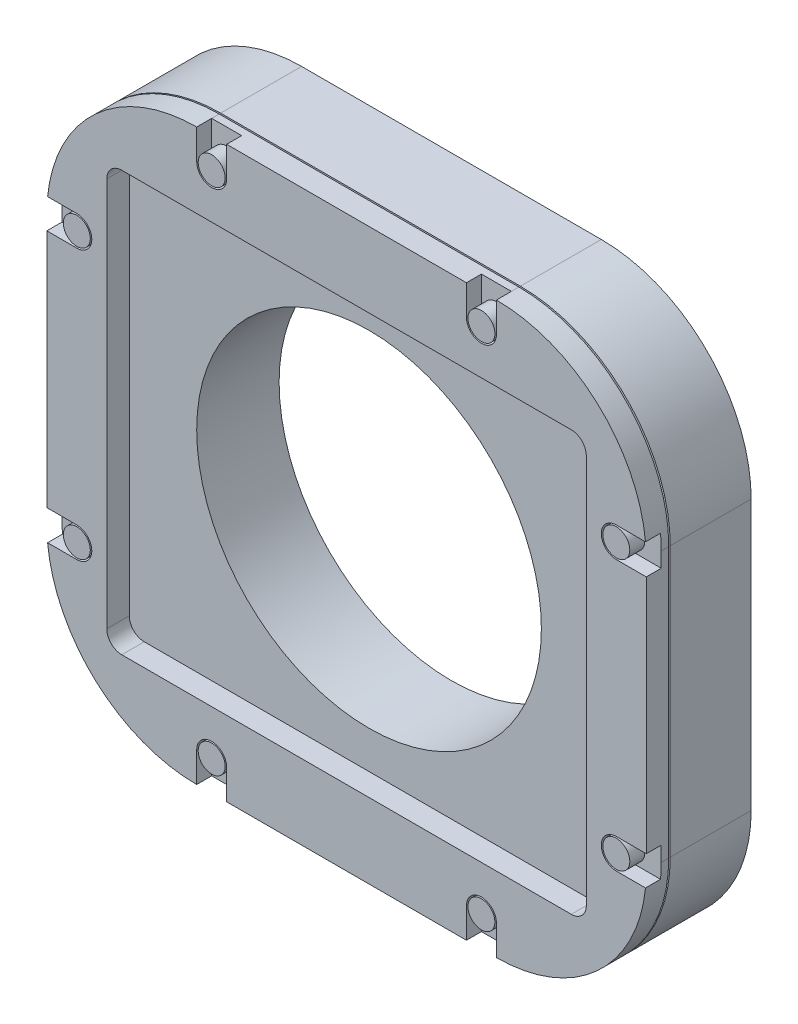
ISO-10303-21;
HEADER;
FILE_DESCRIPTION(('STEP AP214'),'2;1');
FILE_NAME('part.step','',(''),(''),'','','');
FILE_SCHEMA(('AUTOMOTIVE_DESIGN { 1 0 10303 214 1 1 1 1 }'));
ENDSEC;
DATA;
#1=APPLICATION_CONTEXT('core data for automotive mechanical design processes');
#2=APPLICATION_PROTOCOL_DEFINITION('international standard','automotive_design',2000,#1);
#3=PRODUCT_CONTEXT('',#1,'mechanical');
#4=PRODUCT('Part','Part','',(#3));
#5=PRODUCT_RELATED_PRODUCT_CATEGORY('part','',(#4));
#6=PRODUCT_DEFINITION_FORMATION('','',#4);
#7=PRODUCT_DEFINITION_CONTEXT('part definition',#1,'design');
#8=PRODUCT_DEFINITION('design','',#6,#7);
#9=PRODUCT_DEFINITION_SHAPE('','',#8);
#10=(LENGTH_UNIT() NAMED_UNIT(*) SI_UNIT(.MILLI.,.METRE.));
#11=(NAMED_UNIT(*) PLANE_ANGLE_UNIT() SI_UNIT($,.RADIAN.));
#12=(NAMED_UNIT(*) SI_UNIT($,.STERADIAN.) SOLID_ANGLE_UNIT());
#13=UNCERTAINTY_MEASURE_WITH_UNIT(LENGTH_MEASURE(1.E-05),#10,'distance_accuracy_value','');
#14=(GEOMETRIC_REPRESENTATION_CONTEXT(3) GLOBAL_UNCERTAINTY_ASSIGNED_CONTEXT((#13)) GLOBAL_UNIT_ASSIGNED_CONTEXT((#10,
#11,#12)) REPRESENTATION_CONTEXT('',''));
#15=CARTESIAN_POINT('',(0.,0.,0.));
#16=DIRECTION('',(0.,0.,1.));
#17=DIRECTION('',(1.,0.,0.));
#18=AXIS2_PLACEMENT_3D('',#15,#16,#17);
#19=CARTESIAN_POINT('',(9.,-17.,6.));
#20=DIRECTION('',(0.,0.,-1.));
#21=DIRECTION('',(-1.,0.,0.));
#22=AXIS2_PLACEMENT_3D('',#19,#20,#21);
#23=PLANE('',#22);
#24=CARTESIAN_POINT('',(9.,-17.,6.));
#25=DIRECTION('',(0.,0.,1.));
#26=DIRECTION('',(-1.,0.,0.));
#27=AXIS2_PLACEMENT_3D('',#24,#25,#26);
#28=CIRCLE('',#27,1.);
#29=CARTESIAN_POINT('',(10.,-17.,6.));
#30=VERTEX_POINT('',#29);
#31=CARTESIAN_POINT('',(8.,-17.,6.));
#32=VERTEX_POINT('',#31);
#33=EDGE_CURVE('E540',#30,#32,#28,.T.);
#34=ORIENTED_EDGE('',*,*,#33,.T.);
#35=DIRECTION('',(0.,-1.,0.));
#36=VECTOR('',#35,1.);
#37=CARTESIAN_POINT('',(8.,-17.,6.));
#38=LINE('',#37,#36);
#39=CARTESIAN_POINT('',(8.,-19.,6.));
#40=VERTEX_POINT('',#39);
#41=EDGE_CURVE('E543',#32,#40,#38,.T.);
#42=ORIENTED_EDGE('',*,*,#41,.T.);
#43=DIRECTION('',(1.,0.,0.));
#44=VECTOR('',#43,1.);
#45=CARTESIAN_POINT('',(9.99999999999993,-19.,6.));
#46=LINE('',#45,#44);
#47=CARTESIAN_POINT('',(9.99999999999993,-19.,6.));
#48=VERTEX_POINT('',#47);
#49=EDGE_CURVE('E545',#40,#48,#46,.T.);
#50=ORIENTED_EDGE('',*,*,#49,.T.);
#51=DIRECTION('',(0.,1.,0.));
#52=VECTOR('',#51,1.);
#53=CARTESIAN_POINT('',(10.,-17.,6.));
#54=LINE('',#53,#52);
#55=EDGE_CURVE('E547',#48,#30,#54,.T.);
#56=ORIENTED_EDGE('',*,*,#55,.T.);
#57=EDGE_LOOP('',(#34,#42,#50,#56));
#58=FACE_BOUND('',#57,.T.);
#59=CARTESIAN_POINT('',(9.,-17.,6.));
#60=DIRECTION('',(0.,0.,-1.));
#61=DIRECTION('',(-1.,0.,0.));
#62=AXIS2_PLACEMENT_3D('',#59,#60,#61);
#63=CIRCLE('',#62,0.900000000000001);
#64=CARTESIAN_POINT('',(8.1,-17.,6.));
#65=VERTEX_POINT('',#64);
#66=EDGE_CURVE('E11',#65,#65,#63,.F.);
#67=ORIENTED_EDGE('',*,*,#66,.F.);
#68=EDGE_LOOP('',(#67));
#69=FACE_BOUND('',#68,.T.);
#70=ADVANCED_FACE('F31',(#58,#69),#23,.F.);
#71=CARTESIAN_POINT('',(10.,-9.,6.));
#72=DIRECTION('',(0.,0.,-1.));
#73=DIRECTION('',(-1.,0.,0.));
#74=AXIS2_PLACEMENT_3D('',#71,#72,#73);
#75=PLANE('',#74);
#76=CARTESIAN_POINT('',(10.,-9.,6.));
#77=DIRECTION('',(0.,0.,1.));
#78=DIRECTION('',(-1.,0.,0.));
#79=AXIS2_PLACEMENT_3D('',#76,#77,#78);
#80=CIRCLE('',#79,10.);
#81=CARTESIAN_POINT('',(19.9498743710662,-10.,6.));
#82=VERTEX_POINT('',#81);
#83=CARTESIAN_POINT('',(20.,-8.99999999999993,6.));
#84=VERTEX_POINT('',#83);
#85=EDGE_CURVE('E651',#82,#84,#80,.T.);
#86=ORIENTED_EDGE('',*,*,#85,.T.);
#87=DIRECTION('',(0.,1.,0.));
#88=VECTOR('',#87,1.);
#89=CARTESIAN_POINT('',(20.,-8.,6.));
#90=LINE('',#89,#88);
#91=CARTESIAN_POINT('',(20.,-8.,6.));
#92=VERTEX_POINT('',#91);
#93=EDGE_CURVE('E653',#84,#92,#90,.T.);
#94=ORIENTED_EDGE('',*,*,#93,.T.);
#95=DIRECTION('',(-1.,0.,0.));
#96=VECTOR('',#95,1.);
#97=CARTESIAN_POINT('',(18.,-8.,6.));
#98=LINE('',#97,#96);
#99=CARTESIAN_POINT('',(18.,-8.,6.));
#100=VERTEX_POINT('',#99);
#101=EDGE_CURVE('E656',#92,#100,#98,.T.);
#102=ORIENTED_EDGE('',*,*,#101,.T.);
#103=CARTESIAN_POINT('',(18.,-9.,6.));
#104=DIRECTION('',(0.,0.,1.));
#105=DIRECTION('',(-1.,0.,0.));
#106=AXIS2_PLACEMENT_3D('',#103,#104,#105);
#107=CIRCLE('',#106,1.);
#108=CARTESIAN_POINT('',(18.,-10.,6.));
#109=VERTEX_POINT('',#108);
#110=EDGE_CURVE('E659',#100,#109,#107,.T.);
#111=ORIENTED_EDGE('',*,*,#110,.T.);
#112=DIRECTION('',(1.,0.,0.));
#113=VECTOR('',#112,1.);
#114=CARTESIAN_POINT('',(18.,-10.,6.));
#115=LINE('',#114,#113);
#116=EDGE_CURVE('E662',#109,#82,#115,.T.);
#117=ORIENTED_EDGE('',*,*,#116,.T.);
#118=EDGE_LOOP('',(#86,#94,#102,#111,#117));
#119=FACE_BOUND('',#118,.T.);
#120=CARTESIAN_POINT('',(18.,-9.,6.));
#121=DIRECTION('',(0.,0.,-1.));
#122=DIRECTION('',(-1.,0.,0.));
#123=AXIS2_PLACEMENT_3D('',#120,#121,#122);
#124=CIRCLE('',#123,0.9);
#125=CARTESIAN_POINT('',(17.1,-9.,6.));
#126=VERTEX_POINT('',#125);
#127=EDGE_CURVE('E39',#126,#126,#124,.F.);
#128=ORIENTED_EDGE('',*,*,#127,.F.);
#129=EDGE_LOOP('',(#128));
#130=FACE_BOUND('',#129,.T.);
#131=ADVANCED_FACE('F919',(#119,#130),#75,.F.);
#132=CARTESIAN_POINT('',(-18.,-9.,6.));
#133=DIRECTION('',(0.,0.,1.));
#134=DIRECTION('',(1.,0.,0.));
#135=AXIS2_PLACEMENT_3D('',#132,#133,#134);
#136=PLANE('',#135);
#137=CARTESIAN_POINT('',(-18.,-9.,6.));
#138=DIRECTION('',(0.,0.,1.));
#139=DIRECTION('',(1.,0.,0.));
#140=AXIS2_PLACEMENT_3D('',#137,#138,#139);
#141=CIRCLE('',#140,1.);
#142=CARTESIAN_POINT('',(-18.,-10.,6.));
#143=VERTEX_POINT('',#142);
#144=CARTESIAN_POINT('',(-18.,-8.,6.));
#145=VERTEX_POINT('',#144);
#146=EDGE_CURVE('E565',#143,#145,#141,.T.);
#147=ORIENTED_EDGE('',*,*,#146,.T.);
#148=DIRECTION('',(-1.,0.,0.));
#149=VECTOR('',#148,1.);
#150=CARTESIAN_POINT('',(-18.,-8.,6.));
#151=LINE('',#150,#149);
#152=CARTESIAN_POINT('',(-20.,-8.,6.));
#153=VERTEX_POINT('',#152);
#154=EDGE_CURVE('E568',#145,#153,#151,.T.);
#155=ORIENTED_EDGE('',*,*,#154,.T.);
#156=DIRECTION('',(0.,-1.,0.));
#157=VECTOR('',#156,1.);
#158=CARTESIAN_POINT('',(-20.,-8.,6.));
#159=LINE('',#158,#157);
#160=CARTESIAN_POINT('',(-20.,-8.99999999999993,6.));
#161=VERTEX_POINT('',#160);
#162=EDGE_CURVE('E571',#153,#161,#159,.T.);
#163=ORIENTED_EDGE('',*,*,#162,.T.);
#164=CARTESIAN_POINT('',(-10.,-9.,6.));
#165=DIRECTION('',(0.,0.,1.));
#166=DIRECTION('',(1.,0.,0.));
#167=AXIS2_PLACEMENT_3D('',#164,#165,#166);
#168=CIRCLE('',#167,10.);
#169=CARTESIAN_POINT('',(-19.9498743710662,-10.,6.));
#170=VERTEX_POINT('',#169);
#171=EDGE_CURVE('E573',#161,#170,#168,.T.);
#172=ORIENTED_EDGE('',*,*,#171,.T.);
#173=DIRECTION('',(1.,0.,0.));
#174=VECTOR('',#173,1.);
#175=CARTESIAN_POINT('',(-18.,-10.,6.));
#176=LINE('',#175,#174);
#177=EDGE_CURVE('E575',#170,#143,#176,.T.);
#178=ORIENTED_EDGE('',*,*,#177,.T.);
#179=EDGE_LOOP('',(#147,#155,#163,#172,#178));
#180=FACE_BOUND('',#179,.T.);
#181=CARTESIAN_POINT('',(-18.,-9.,6.));
#182=DIRECTION('',(0.,0.,1.));
#183=DIRECTION('',(1.,0.,0.));
#184=AXIS2_PLACEMENT_3D('',#181,#182,#183);
#185=CIRCLE('',#184,0.9);
#186=CARTESIAN_POINT('',(-17.1,-9.,6.));
#187=VERTEX_POINT('',#186);
#188=EDGE_CURVE('E1363',#187,#187,#185,.T.);
#189=ORIENTED_EDGE('',*,*,#188,.F.);
#190=EDGE_LOOP('',(#189));
#191=FACE_BOUND('',#190,.T.);
#192=ADVANCED_FACE('F921',(#180,#191),#136,.T.);
#193=CARTESIAN_POINT('',(-9.,-17.,6.));
#194=DIRECTION('',(0.,0.,1.));
#195=DIRECTION('',(1.,0.,0.));
#196=AXIS2_PLACEMENT_3D('',#193,#194,#195);
#197=PLANE('',#196);
#198=CARTESIAN_POINT('',(-9.,-17.,6.));
#199=DIRECTION('',(0.,0.,1.));
#200=DIRECTION('',(1.,0.,0.));
#201=AXIS2_PLACEMENT_3D('',#198,#199,#200);
#202=CIRCLE('',#201,1.);
#203=CARTESIAN_POINT('',(-8.,-17.,6.));
#204=VERTEX_POINT('',#203);
#205=CARTESIAN_POINT('',(-10.,-17.,6.));
#206=VERTEX_POINT('',#205);
#207=EDGE_CURVE('E596',#204,#206,#202,.T.);
#208=ORIENTED_EDGE('',*,*,#207,.T.);
#209=DIRECTION('',(0.,-1.,0.));
#210=VECTOR('',#209,1.);
#211=CARTESIAN_POINT('',(-10.,-17.,6.));
#212=LINE('',#211,#210);
#213=CARTESIAN_POINT('',(-9.99999999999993,-19.,6.));
#214=VERTEX_POINT('',#213);
#215=EDGE_CURVE('E599',#206,#214,#212,.T.);
#216=ORIENTED_EDGE('',*,*,#215,.T.);
#217=DIRECTION('',(1.,0.,0.));
#218=VECTOR('',#217,1.);
#219=CARTESIAN_POINT('',(-9.99999999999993,-19.,6.));
#220=LINE('',#219,#218);
#221=CARTESIAN_POINT('',(-8.,-19.,6.));
#222=VERTEX_POINT('',#221);
#223=EDGE_CURVE('E601',#214,#222,#220,.T.);
#224=ORIENTED_EDGE('',*,*,#223,.T.);
#225=DIRECTION('',(0.,1.,0.));
#226=VECTOR('',#225,1.);
#227=CARTESIAN_POINT('',(-8.,-17.,6.));
#228=LINE('',#227,#226);
#229=EDGE_CURVE('E603',#222,#204,#228,.T.);
#230=ORIENTED_EDGE('',*,*,#229,.T.);
#231=EDGE_LOOP('',(#208,#216,#224,#230));
#232=FACE_BOUND('',#231,.T.);
#233=CARTESIAN_POINT('',(-9.,-17.,6.));
#234=DIRECTION('',(0.,0.,1.));
#235=DIRECTION('',(1.,0.,0.));
#236=AXIS2_PLACEMENT_3D('',#233,#234,#235);
#237=CIRCLE('',#236,0.900000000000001);
#238=CARTESIAN_POINT('',(-8.1,-17.,6.));
#239=VERTEX_POINT('',#238);
#240=EDGE_CURVE('E1371',#239,#239,#237,.T.);
#241=ORIENTED_EDGE('',*,*,#240,.F.);
#242=EDGE_LOOP('',(#241));
#243=FACE_BOUND('',#242,.T.);
#244=ADVANCED_FACE('F928',(#232,#243),#197,.T.);
#245=CARTESIAN_POINT('',(-9.,17.,6.));
#246=DIRECTION('',(0.,0.,-1.));
#247=DIRECTION('',(-1.,0.,0.));
#248=AXIS2_PLACEMENT_3D('',#245,#246,#247);
#249=PLANE('',#248);
#250=DIRECTION('',(-1.,0.,0.));
#251=VECTOR('',#250,1.);
#252=CARTESIAN_POINT('',(-9.99999999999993,19.,6.));
#253=LINE('',#252,#251);
#254=CARTESIAN_POINT('',(-8.,19.,6.));
#255=VERTEX_POINT('',#254);
#256=CARTESIAN_POINT('',(-9.99999999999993,19.,6.));
#257=VERTEX_POINT('',#256);
#258=EDGE_CURVE('E682',#255,#257,#253,.T.);
#259=ORIENTED_EDGE('',*,*,#258,.T.);
#260=DIRECTION('',(0.,-1.,0.));
#261=VECTOR('',#260,1.);
#262=CARTESIAN_POINT('',(-10.,17.,6.));
#263=LINE('',#262,#261);
#264=CARTESIAN_POINT('',(-10.,17.,6.));
#265=VERTEX_POINT('',#264);
#266=EDGE_CURVE('E684',#257,#265,#263,.T.);
#267=ORIENTED_EDGE('',*,*,#266,.T.);
#268=CARTESIAN_POINT('',(-9.,17.,6.));
#269=DIRECTION('',(0.,0.,1.));
#270=DIRECTION('',(-1.,0.,0.));
#271=AXIS2_PLACEMENT_3D('',#268,#269,#270);
#272=CIRCLE('',#271,1.);
#273=CARTESIAN_POINT('',(-8.,17.,6.));
#274=VERTEX_POINT('',#273);
#275=EDGE_CURVE('E687',#265,#274,#272,.T.);
#276=ORIENTED_EDGE('',*,*,#275,.T.);
#277=DIRECTION('',(0.,1.,0.));
#278=VECTOR('',#277,1.);
#279=CARTESIAN_POINT('',(-8.,17.,6.));
#280=LINE('',#279,#278);
#281=EDGE_CURVE('E690',#274,#255,#280,.T.);
#282=ORIENTED_EDGE('',*,*,#281,.T.);
#283=EDGE_LOOP('',(#259,#267,#276,#282));
#284=FACE_BOUND('',#283,.T.);
#285=CARTESIAN_POINT('',(-9.,17.,6.));
#286=DIRECTION('',(0.,0.,-1.));
#287=DIRECTION('',(-1.,0.,0.));
#288=AXIS2_PLACEMENT_3D('',#285,#286,#287);
#289=CIRCLE('',#288,0.900000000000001);
#290=CARTESIAN_POINT('',(-9.9,17.,6.));
#291=VERTEX_POINT('',#290);
#292=EDGE_CURVE('E912',#291,#291,#289,.F.);
#293=ORIENTED_EDGE('',*,*,#292,.F.);
#294=EDGE_LOOP('',(#293));
#295=FACE_BOUND('',#294,.T.);
#296=ADVANCED_FACE('F951',(#284,#295),#249,.F.);
#297=CARTESIAN_POINT('',(-10.,9.,6.));
#298=DIRECTION('',(0.,0.,-1.));
#299=DIRECTION('',(-1.,0.,0.));
#300=AXIS2_PLACEMENT_3D('',#297,#298,#299);
#301=PLANE('',#300);
#302=CARTESIAN_POINT('',(-10.,9.,6.));
#303=DIRECTION('',(0.,0.,1.));
#304=DIRECTION('',(-1.,0.,0.));
#305=AXIS2_PLACEMENT_3D('',#302,#303,#304);
#306=CIRCLE('',#305,10.);
#307=CARTESIAN_POINT('',(-19.9498743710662,10.,6.));
#308=VERTEX_POINT('',#307);
#309=CARTESIAN_POINT('',(-20.,8.99999999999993,6.));
#310=VERTEX_POINT('',#309);
#311=EDGE_CURVE('E620',#308,#310,#306,.T.);
#312=ORIENTED_EDGE('',*,*,#311,.T.);
#313=DIRECTION('',(0.,-1.,0.));
#314=VECTOR('',#313,1.);
#315=CARTESIAN_POINT('',(-20.,8.,6.));
#316=LINE('',#315,#314);
#317=CARTESIAN_POINT('',(-20.,8.,6.));
#318=VERTEX_POINT('',#317);
#319=EDGE_CURVE('E622',#310,#318,#316,.T.);
#320=ORIENTED_EDGE('',*,*,#319,.T.);
#321=DIRECTION('',(1.,0.,0.));
#322=VECTOR('',#321,1.);
#323=CARTESIAN_POINT('',(-18.,8.,6.));
#324=LINE('',#323,#322);
#325=CARTESIAN_POINT('',(-18.,8.,6.));
#326=VERTEX_POINT('',#325);
#327=EDGE_CURVE('E625',#318,#326,#324,.T.);
#328=ORIENTED_EDGE('',*,*,#327,.T.);
#329=CARTESIAN_POINT('',(-18.,9.,6.));
#330=DIRECTION('',(0.,0.,1.));
#331=DIRECTION('',(-1.,0.,0.));
#332=AXIS2_PLACEMENT_3D('',#329,#330,#331);
#333=CIRCLE('',#332,1.);
#334=CARTESIAN_POINT('',(-18.,10.,6.));
#335=VERTEX_POINT('',#334);
#336=EDGE_CURVE('E628',#326,#335,#333,.T.);
#337=ORIENTED_EDGE('',*,*,#336,.T.);
#338=DIRECTION('',(-1.,0.,0.));
#339=VECTOR('',#338,1.);
#340=CARTESIAN_POINT('',(-18.,10.,6.));
#341=LINE('',#340,#339);
#342=EDGE_CURVE('E631',#335,#308,#341,.T.);
#343=ORIENTED_EDGE('',*,*,#342,.T.);
#344=EDGE_LOOP('',(#312,#320,#328,#337,#343));
#345=FACE_BOUND('',#344,.T.);
#346=CARTESIAN_POINT('',(-18.,9.,6.));
#347=DIRECTION('',(0.,0.,-1.));
#348=DIRECTION('',(-1.,0.,0.));
#349=AXIS2_PLACEMENT_3D('',#346,#347,#348);
#350=CIRCLE('',#349,0.9);
#351=CARTESIAN_POINT('',(-18.9,9.,6.));
#352=VERTEX_POINT('',#351);
#353=EDGE_CURVE('E907',#352,#352,#350,.F.);
#354=ORIENTED_EDGE('',*,*,#353,.F.);
#355=EDGE_LOOP('',(#354));
#356=FACE_BOUND('',#355,.T.);
#357=ADVANCED_FACE('F954',(#345,#356),#301,.F.);
#358=CARTESIAN_POINT('',(10.,9.,6.));
#359=DIRECTION('',(0.,0.,1.));
#360=DIRECTION('',(1.,0.,0.));
#361=AXIS2_PLACEMENT_3D('',#358,#359,#360);
#362=PLANE('',#361);
#363=CARTESIAN_POINT('',(10.,9.,6.));
#364=DIRECTION('',(0.,0.,1.));
#365=DIRECTION('',(1.,0.,0.));
#366=AXIS2_PLACEMENT_3D('',#363,#364,#365);
#367=CIRCLE('',#366,10.);
#368=CARTESIAN_POINT('',(20.,8.99999999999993,6.));
#369=VERTEX_POINT('',#368);
#370=CARTESIAN_POINT('',(19.9498743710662,10.,6.));
#371=VERTEX_POINT('',#370);
#372=EDGE_CURVE('E709',#369,#371,#367,.T.);
#373=ORIENTED_EDGE('',*,*,#372,.T.);
#374=DIRECTION('',(-1.,0.,0.));
#375=VECTOR('',#374,1.);
#376=CARTESIAN_POINT('',(18.,10.,6.));
#377=LINE('',#376,#375);
#378=CARTESIAN_POINT('',(18.,10.,6.));
#379=VERTEX_POINT('',#378);
#380=EDGE_CURVE('E712',#371,#379,#377,.T.);
#381=ORIENTED_EDGE('',*,*,#380,.T.);
#382=CARTESIAN_POINT('',(18.,9.,6.));
#383=DIRECTION('',(0.,0.,1.));
#384=DIRECTION('',(1.,0.,0.));
#385=AXIS2_PLACEMENT_3D('',#382,#383,#384);
#386=CIRCLE('',#385,1.);
#387=CARTESIAN_POINT('',(18.,8.,6.));
#388=VERTEX_POINT('',#387);
#389=EDGE_CURVE('E715',#379,#388,#386,.T.);
#390=ORIENTED_EDGE('',*,*,#389,.T.);
#391=DIRECTION('',(1.,0.,0.));
#392=VECTOR('',#391,1.);
#393=CARTESIAN_POINT('',(18.,8.,6.));
#394=LINE('',#393,#392);
#395=CARTESIAN_POINT('',(20.,8.,6.));
#396=VERTEX_POINT('',#395);
#397=EDGE_CURVE('E718',#388,#396,#394,.T.);
#398=ORIENTED_EDGE('',*,*,#397,.T.);
#399=DIRECTION('',(0.,1.,0.));
#400=VECTOR('',#399,1.);
#401=CARTESIAN_POINT('',(20.,8.,6.));
#402=LINE('',#401,#400);
#403=EDGE_CURVE('E721',#396,#369,#402,.T.);
#404=ORIENTED_EDGE('',*,*,#403,.T.);
#405=EDGE_LOOP('',(#373,#381,#390,#398,#404));
#406=FACE_BOUND('',#405,.T.);
#407=CARTESIAN_POINT('',(18.,9.,6.));
#408=DIRECTION('',(0.,0.,1.));
#409=DIRECTION('',(1.,0.,0.));
#410=AXIS2_PLACEMENT_3D('',#407,#408,#409);
#411=CIRCLE('',#410,0.9);
#412=CARTESIAN_POINT('',(18.9,9.,6.));
#413=VERTEX_POINT('',#412);
#414=EDGE_CURVE('E1383',#413,#413,#411,.T.);
#415=ORIENTED_EDGE('',*,*,#414,.F.);
#416=EDGE_LOOP('',(#415));
#417=FACE_BOUND('',#416,.T.);
#418=ADVANCED_FACE('F968',(#406,#417),#362,.T.);
#419=CARTESIAN_POINT('',(9.,17.,6.));
#420=DIRECTION('',(0.,0.,1.));
#421=DIRECTION('',(1.,0.,0.));
#422=AXIS2_PLACEMENT_3D('',#419,#420,#421);
#423=PLANE('',#422);
#424=DIRECTION('',(0.,-1.,0.));
#425=VECTOR('',#424,1.);
#426=CARTESIAN_POINT('',(8.,17.,6.));
#427=LINE('',#426,#425);
#428=CARTESIAN_POINT('',(8.,19.,6.));
#429=VERTEX_POINT('',#428);
#430=CARTESIAN_POINT('',(8.,17.,6.));
#431=VERTEX_POINT('',#430);
#432=EDGE_CURVE('E741',#429,#431,#427,.T.);
#433=ORIENTED_EDGE('',*,*,#432,.T.);
#434=CARTESIAN_POINT('',(9.,17.,6.));
#435=DIRECTION('',(0.,0.,1.));
#436=DIRECTION('',(1.,0.,0.));
#437=AXIS2_PLACEMENT_3D('',#434,#435,#436);
#438=CIRCLE('',#437,1.);
#439=CARTESIAN_POINT('',(10.,17.,6.));
#440=VERTEX_POINT('',#439);
#441=EDGE_CURVE('E744',#431,#440,#438,.T.);
#442=ORIENTED_EDGE('',*,*,#441,.T.);
#443=DIRECTION('',(0.,1.,0.));
#444=VECTOR('',#443,1.);
#445=CARTESIAN_POINT('',(10.,17.,6.));
#446=LINE('',#445,#444);
#447=CARTESIAN_POINT('',(9.99999999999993,19.,6.));
#448=VERTEX_POINT('',#447);
#449=EDGE_CURVE('E747',#440,#448,#446,.T.);
#450=ORIENTED_EDGE('',*,*,#449,.T.);
#451=DIRECTION('',(-1.,0.,0.));
#452=VECTOR('',#451,1.);
#453=CARTESIAN_POINT('',(9.99999999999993,19.,6.));
#454=LINE('',#453,#452);
#455=EDGE_CURVE('E749',#448,#429,#454,.T.);
#456=ORIENTED_EDGE('',*,*,#455,.T.);
#457=EDGE_LOOP('',(#433,#442,#450,#456));
#458=FACE_BOUND('',#457,.T.);
#459=CARTESIAN_POINT('',(9.,17.,6.));
#460=DIRECTION('',(0.,0.,1.));
#461=DIRECTION('',(1.,0.,0.));
#462=AXIS2_PLACEMENT_3D('',#459,#460,#461);
#463=CIRCLE('',#462,0.900000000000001);
#464=CARTESIAN_POINT('',(9.9,17.,6.));
#465=VERTEX_POINT('',#464);
#466=EDGE_CURVE('E1389',#465,#465,#463,.T.);
#467=ORIENTED_EDGE('',*,*,#466,.F.);
#468=EDGE_LOOP('',(#467));
#469=FACE_BOUND('',#468,.T.);
#470=ADVANCED_FACE('F971',(#458,#469),#423,.T.);
#471=CARTESIAN_POINT('',(10.,-9.,7.));
#472=DIRECTION('',(0.,0.,-1.));
#473=DIRECTION('',(-1.,0.,0.));
#474=AXIS2_PLACEMENT_3D('',#471,#472,#473);
#475=CYLINDRICAL_SURFACE('',#474,10.);
#476=CARTESIAN_POINT('',(10.,-9.,5.4));
#477=DIRECTION('',(0.,0.,1.));
#478=DIRECTION('',(1.,0.,0.));
#479=AXIS2_PLACEMENT_3D('',#476,#477,#478);
#480=CIRCLE('',#479,10.);
#481=CARTESIAN_POINT('',(9.99999999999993,-19.,5.4));
#482=VERTEX_POINT('',#481);
#483=CARTESIAN_POINT('',(20.,-8.99999999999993,5.4));
#484=VERTEX_POINT('',#483);
#485=EDGE_CURVE('E528',#482,#484,#480,.T.);
#486=ORIENTED_EDGE('',*,*,#485,.F.);
#487=DIRECTION('',(0.,0.,-1.));
#488=VECTOR('',#487,1.);
#489=CARTESIAN_POINT('',(9.99999999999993,-19.,7.));
#490=LINE('',#489,#488);
#491=CARTESIAN_POINT('',(9.99999999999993,-19.,0.));
#492=VERTEX_POINT('',#491);
#493=EDGE_CURVE('E871',#482,#492,#490,.T.);
#494=ORIENTED_EDGE('',*,*,#493,.T.);
#495=CARTESIAN_POINT('',(10.,-9.,0.));
#496=DIRECTION('',(0.,0.,1.));
#497=DIRECTION('',(1.,0.,0.));
#498=AXIS2_PLACEMENT_3D('',#495,#496,#497);
#499=CIRCLE('',#498,10.);
#500=CARTESIAN_POINT('',(20.,-8.99999999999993,0.));
#501=VERTEX_POINT('',#500);
#502=EDGE_CURVE('E826',#492,#501,#499,.T.);
#503=ORIENTED_EDGE('',*,*,#502,.T.);
#504=DIRECTION('',(0.,0.,-1.));
#505=VECTOR('',#504,1.);
#506=CARTESIAN_POINT('',(20.,-8.99999999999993,7.));
#507=LINE('',#506,#505);
#508=EDGE_CURVE('E903',#484,#501,#507,.T.);
#509=ORIENTED_EDGE('',*,*,#508,.F.);
#510=EDGE_LOOP('',(#486,#494,#503,#509));
#511=FACE_BOUND('',#510,.T.);
#512=ADVANCED_FACE('F987',(#511),#475,.T.);
#513=CARTESIAN_POINT('',(20.,8.99999999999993,7.));
#514=DIRECTION('',(-1.,0.,0.));
#515=DIRECTION('',(0.,-1.,0.));
#516=AXIS2_PLACEMENT_3D('',#513,#514,#515);
#517=PLANE('',#516);
#518=DIRECTION('',(0.,1.,0.));
#519=VECTOR('',#518,1.);
#520=CARTESIAN_POINT('',(20.,-8.99999999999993,5.4));
#521=LINE('',#520,#519);
#522=CARTESIAN_POINT('',(20.,8.99999999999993,5.4));
#523=VERTEX_POINT('',#522);
#524=EDGE_CURVE('E530',#484,#523,#521,.T.);
#525=ORIENTED_EDGE('',*,*,#524,.F.);
#526=ORIENTED_EDGE('',*,*,#508,.T.);
#527=DIRECTION('',(0.,1.,0.));
#528=VECTOR('',#527,1.);
#529=CARTESIAN_POINT('',(20.,8.99999999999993,0.));
#530=LINE('',#529,#528);
#531=CARTESIAN_POINT('',(20.,8.99999999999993,0.));
#532=VERTEX_POINT('',#531);
#533=EDGE_CURVE('E829',#501,#532,#530,.T.);
#534=ORIENTED_EDGE('',*,*,#533,.T.);
#535=DIRECTION('',(0.,0.,-1.));
#536=VECTOR('',#535,1.);
#537=CARTESIAN_POINT('',(20.,8.99999999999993,7.));
#538=LINE('',#537,#536);
#539=EDGE_CURVE('E898',#523,#532,#538,.T.);
#540=ORIENTED_EDGE('',*,*,#539,.F.);
#541=EDGE_LOOP('',(#525,#526,#534,#540));
#542=FACE_BOUND('',#541,.T.);
#543=ADVANCED_FACE('F1080',(#542),#517,.F.);
#544=CARTESIAN_POINT('',(10.,9.,7.));
#545=DIRECTION('',(0.,0.,-1.));
#546=DIRECTION('',(-1.,0.,0.));
#547=AXIS2_PLACEMENT_3D('',#544,#545,#546);
#548=CYLINDRICAL_SURFACE('',#547,10.);
#549=CARTESIAN_POINT('',(10.,9.,5.4));
#550=DIRECTION('',(0.,0.,1.));
#551=DIRECTION('',(1.,0.,0.));
#552=AXIS2_PLACEMENT_3D('',#549,#550,#551);
#553=CIRCLE('',#552,10.);
#554=CARTESIAN_POINT('',(9.99999999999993,19.,5.4));
#555=VERTEX_POINT('',#554);
#556=EDGE_CURVE('E517',#523,#555,#553,.T.);
#557=ORIENTED_EDGE('',*,*,#556,.F.);
#558=ORIENTED_EDGE('',*,*,#539,.T.);
#559=CARTESIAN_POINT('',(10.,9.,0.));
#560=DIRECTION('',(0.,0.,1.));
#561=DIRECTION('',(-1.,0.,0.));
#562=AXIS2_PLACEMENT_3D('',#559,#560,#561);
#563=CIRCLE('',#562,10.);
#564=CARTESIAN_POINT('',(9.99999999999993,19.,0.));
#565=VERTEX_POINT('',#564);
#566=EDGE_CURVE('E832',#532,#565,#563,.T.);
#567=ORIENTED_EDGE('',*,*,#566,.T.);
#568=DIRECTION('',(0.,0.,-1.));
#569=VECTOR('',#568,1.);
#570=CARTESIAN_POINT('',(9.99999999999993,19.,7.));
#571=LINE('',#570,#569);
#572=EDGE_CURVE('E893',#555,#565,#571,.T.);
#573=ORIENTED_EDGE('',*,*,#572,.F.);
#574=EDGE_LOOP('',(#557,#558,#567,#573));
#575=FACE_BOUND('',#574,.T.);
#576=ADVANCED_FACE('F1077',(#575),#548,.T.);
#577=CARTESIAN_POINT('',(-9.99999999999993,19.,7.));
#578=DIRECTION('',(0.,-1.,0.));
#579=DIRECTION('',(0.,0.,-1.));
#580=AXIS2_PLACEMENT_3D('',#577,#578,#579);
#581=PLANE('',#580);
#582=DIRECTION('',(-1.,0.,0.));
#583=VECTOR('',#582,1.);
#584=CARTESIAN_POINT('',(9.99999999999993,19.,5.4));
#585=LINE('',#584,#583);
#586=CARTESIAN_POINT('',(-9.99999999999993,19.,5.4));
#587=VERTEX_POINT('',#586);
#588=EDGE_CURVE('E519',#555,#587,#585,.T.);
#589=ORIENTED_EDGE('',*,*,#588,.F.);
#590=ORIENTED_EDGE('',*,*,#572,.T.);
#591=DIRECTION('',(-1.,0.,0.));
#592=VECTOR('',#591,1.);
#593=CARTESIAN_POINT('',(-9.99999999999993,19.,0.));
#594=LINE('',#593,#592);
#595=CARTESIAN_POINT('',(-9.99999999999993,19.,0.));
#596=VERTEX_POINT('',#595);
#597=EDGE_CURVE('E835',#565,#596,#594,.T.);
#598=ORIENTED_EDGE('',*,*,#597,.T.);
#599=DIRECTION('',(0.,0.,-1.));
#600=VECTOR('',#599,1.);
#601=CARTESIAN_POINT('',(-9.99999999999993,19.,7.));
#602=LINE('',#601,#600);
#603=EDGE_CURVE('E889',#587,#596,#602,.T.);
#604=ORIENTED_EDGE('',*,*,#603,.F.);
#605=EDGE_LOOP('',(#589,#590,#598,#604));
#606=FACE_BOUND('',#605,.T.);
#607=ADVANCED_FACE('F1073',(#606),#581,.F.);
#608=CARTESIAN_POINT('',(-10.,9.,7.));
#609=DIRECTION('',(0.,0.,-1.));
#610=DIRECTION('',(-1.,0.,0.));
#611=AXIS2_PLACEMENT_3D('',#608,#609,#610);
#612=CYLINDRICAL_SURFACE('',#611,10.);
#613=CARTESIAN_POINT('',(-10.,9.,5.4));
#614=DIRECTION('',(0.,0.,1.));
#615=DIRECTION('',(1.,0.,0.));
#616=AXIS2_PLACEMENT_3D('',#613,#614,#615);
#617=CIRCLE('',#616,9.99999999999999);
#618=CARTESIAN_POINT('',(-20.,8.99999999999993,5.4));
#619=VERTEX_POINT('',#618);
#620=EDGE_CURVE('E521',#587,#619,#617,.T.);
#621=ORIENTED_EDGE('',*,*,#620,.F.);
#622=ORIENTED_EDGE('',*,*,#603,.T.);
#623=CARTESIAN_POINT('',(-10.,9.,0.));
#624=DIRECTION('',(0.,0.,1.));
#625=DIRECTION('',(1.,0.,0.));
#626=AXIS2_PLACEMENT_3D('',#623,#624,#625);
#627=CIRCLE('',#626,10.);
#628=CARTESIAN_POINT('',(-20.,8.99999999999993,0.));
#629=VERTEX_POINT('',#628);
#630=EDGE_CURVE('E838',#596,#629,#627,.T.);
#631=ORIENTED_EDGE('',*,*,#630,.T.);
#632=DIRECTION('',(0.,0.,-1.));
#633=VECTOR('',#632,1.);
#634=CARTESIAN_POINT('',(-20.,8.99999999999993,7.));
#635=LINE('',#634,#633);
#636=EDGE_CURVE('E885',#619,#629,#635,.T.);
#637=ORIENTED_EDGE('',*,*,#636,.F.);
#638=EDGE_LOOP('',(#621,#622,#631,#637));
#639=FACE_BOUND('',#638,.T.);
#640=ADVANCED_FACE('F1068',(#639),#612,.T.);
#641=CARTESIAN_POINT('',(-20.,8.99999999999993,7.));
#642=DIRECTION('',(1.,0.,0.));
#643=DIRECTION('',(0.,1.,0.));
#644=AXIS2_PLACEMENT_3D('',#641,#642,#643);
#645=PLANE('',#644);
#646=DIRECTION('',(0.,-1.,0.));
#647=VECTOR('',#646,1.);
#648=CARTESIAN_POINT('',(-20.,8.99999999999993,5.4));
#649=LINE('',#648,#647);
#650=CARTESIAN_POINT('',(-20.,-8.99999999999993,5.4));
#651=VERTEX_POINT('',#650);
#652=EDGE_CURVE('E523',#619,#651,#649,.T.);
#653=ORIENTED_EDGE('',*,*,#652,.F.);
#654=ORIENTED_EDGE('',*,*,#636,.T.);
#655=DIRECTION('',(0.,-1.,0.));
#656=VECTOR('',#655,1.);
#657=CARTESIAN_POINT('',(-20.,8.99999999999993,0.));
#658=LINE('',#657,#656);
#659=CARTESIAN_POINT('',(-20.,-8.99999999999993,0.));
#660=VERTEX_POINT('',#659);
#661=EDGE_CURVE('E841',#629,#660,#658,.T.);
#662=ORIENTED_EDGE('',*,*,#661,.T.);
#663=DIRECTION('',(0.,0.,-1.));
#664=VECTOR('',#663,1.);
#665=CARTESIAN_POINT('',(-20.,-8.99999999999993,7.));
#666=LINE('',#665,#664);
#667=EDGE_CURVE('E880',#651,#660,#666,.T.);
#668=ORIENTED_EDGE('',*,*,#667,.F.);
#669=EDGE_LOOP('',(#653,#654,#662,#668));
#670=FACE_BOUND('',#669,.T.);
#671=ADVANCED_FACE('F1063',(#670),#645,.F.);
#672=CARTESIAN_POINT('',(-10.,-9.,7.));
#673=DIRECTION('',(0.,0.,-1.));
#674=DIRECTION('',(-1.,0.,0.));
#675=AXIS2_PLACEMENT_3D('',#672,#673,#674);
#676=CYLINDRICAL_SURFACE('',#675,10.);
#677=CARTESIAN_POINT('',(-10.,-9.,5.4));
#678=DIRECTION('',(0.,0.,1.));
#679=DIRECTION('',(1.,0.,0.));
#680=AXIS2_PLACEMENT_3D('',#677,#678,#679);
#681=CIRCLE('',#680,10.);
#682=CARTESIAN_POINT('',(-9.99999999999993,-19.,5.4));
#683=VERTEX_POINT('',#682);
#684=EDGE_CURVE('E54',#651,#683,#681,.T.);
#685=ORIENTED_EDGE('',*,*,#684,.F.);
#686=ORIENTED_EDGE('',*,*,#667,.T.);
#687=CARTESIAN_POINT('',(-10.,-9.,0.));
#688=DIRECTION('',(0.,0.,1.));
#689=DIRECTION('',(1.,0.,0.));
#690=AXIS2_PLACEMENT_3D('',#687,#688,#689);
#691=CIRCLE('',#690,10.);
#692=CARTESIAN_POINT('',(-9.99999999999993,-19.,0.));
#693=VERTEX_POINT('',#692);
#694=EDGE_CURVE('E844',#660,#693,#691,.T.);
#695=ORIENTED_EDGE('',*,*,#694,.T.);
#696=DIRECTION('',(0.,0.,-1.));
#697=VECTOR('',#696,1.);
#698=CARTESIAN_POINT('',(-9.99999999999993,-19.,7.));
#699=LINE('',#698,#697);
#700=EDGE_CURVE('E875',#683,#693,#699,.T.);
#701=ORIENTED_EDGE('',*,*,#700,.F.);
#702=EDGE_LOOP('',(#685,#686,#695,#701));
#703=FACE_BOUND('',#702,.T.);
#704=ADVANCED_FACE('F1058',(#703),#676,.T.);
#705=CARTESIAN_POINT('',(-9.99999999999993,-19.,7.));
#706=DIRECTION('',(0.,1.,0.));
#707=DIRECTION('',(-1.,0.,0.));
#708=AXIS2_PLACEMENT_3D('',#705,#706,#707);
#709=PLANE('',#708);
#710=DIRECTION('',(1.,0.,0.));
#711=VECTOR('',#710,1.);
#712=CARTESIAN_POINT('',(-9.99999999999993,-19.,5.4));
#713=LINE('',#712,#711);
#714=EDGE_CURVE('E526',#683,#482,#713,.T.);
#715=ORIENTED_EDGE('',*,*,#714,.F.);
#716=ORIENTED_EDGE('',*,*,#700,.T.);
#717=DIRECTION('',(1.,0.,0.));
#718=VECTOR('',#717,1.);
#719=CARTESIAN_POINT('',(-9.99999999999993,-19.,0.));
#720=LINE('',#719,#718);
#721=EDGE_CURVE('E847',#693,#492,#720,.T.);
#722=ORIENTED_EDGE('',*,*,#721,.T.);
#723=ORIENTED_EDGE('',*,*,#493,.F.);
#724=EDGE_LOOP('',(#715,#716,#722,#723));
#725=FACE_BOUND('',#724,.T.);
#726=ADVANCED_FACE('F1041',(#725),#709,.F.);
#727=CARTESIAN_POINT('',(0.,0.,7.));
#728=DIRECTION('',(0.,0.,-1.));
#729=DIRECTION('',(-1.,0.,0.));
#730=AXIS2_PLACEMENT_3D('',#727,#728,#729);
#731=CYLINDRICAL_SURFACE('',#730,11.5);
#732=CARTESIAN_POINT('',(0.,0.,0.));
#733=DIRECTION('',(0.,0.,1.));
#734=DIRECTION('',(1.,0.,0.));
#735=AXIS2_PLACEMENT_3D('',#732,#733,#734);
#736=CIRCLE('',#735,11.5);
#737=CARTESIAN_POINT('',(11.5,0.,0.));
#738=VERTEX_POINT('',#737);
#739=EDGE_CURVE('E823',#738,#738,#736,.T.);
#740=ORIENTED_EDGE('',*,*,#739,.F.);
#741=EDGE_LOOP('',(#740));
#742=FACE_BOUND('',#741,.T.);
#743=CARTESIAN_POINT('',(0.,0.,5.5));
#744=DIRECTION('',(0.,0.,1.));
#745=DIRECTION('',(1.,0.,0.));
#746=AXIS2_PLACEMENT_3D('',#743,#744,#745);
#747=CIRCLE('',#746,11.5);
#748=CARTESIAN_POINT('',(11.5,0.,5.5));
#749=VERTEX_POINT('',#748);
#750=EDGE_CURVE('E808',#749,#749,#747,.T.);
#751=ORIENTED_EDGE('',*,*,#750,.T.);
#752=EDGE_LOOP('',(#751));
#753=FACE_BOUND('',#752,.T.);
#754=ADVANCED_FACE('F1037',(#742,#753),#731,.F.);
#755=CARTESIAN_POINT('',(10.,-9.,7.));
#756=DIRECTION('',(0.,0.,1.));
#757=DIRECTION('',(1.,0.,0.));
#758=AXIS2_PLACEMENT_3D('',#755,#756,#757);
#759=PLANE('',#758);
#760=DIRECTION('',(0.,1.,0.));
#761=VECTOR('',#760,1.);
#762=CARTESIAN_POINT('',(10.,-17.,7.));
#763=LINE('',#762,#761);
#764=CARTESIAN_POINT('',(9.99999999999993,-19.,7.));
#765=VERTEX_POINT('',#764);
#766=CARTESIAN_POINT('',(10.,-17.,7.));
#767=VERTEX_POINT('',#766);
#768=EDGE_CURVE('E537',#765,#767,#763,.T.);
#769=ORIENTED_EDGE('',*,*,#768,.F.);
#770=CARTESIAN_POINT('',(10.,-9.,7.));
#771=DIRECTION('',(0.,0.,1.));
#772=DIRECTION('',(1.,0.,0.));
#773=AXIS2_PLACEMENT_3D('',#770,#771,#772);
#774=CIRCLE('',#773,10.);
#775=CARTESIAN_POINT('',(19.9498743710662,-10.,7.));
#776=VERTEX_POINT('',#775);
#777=EDGE_CURVE('E850',#765,#776,#774,.T.);
#778=ORIENTED_EDGE('',*,*,#777,.T.);
#779=DIRECTION('',(1.,0.,0.));
#780=VECTOR('',#779,1.);
#781=CARTESIAN_POINT('',(18.,-10.,7.));
#782=LINE('',#781,#780);
#783=CARTESIAN_POINT('',(18.,-10.,7.));
#784=VERTEX_POINT('',#783);
#785=EDGE_CURVE('E649',#784,#776,#782,.T.);
#786=ORIENTED_EDGE('',*,*,#785,.F.);
#787=CARTESIAN_POINT('',(18.,-9.,7.));
#788=DIRECTION('',(0.,0.,1.));
#789=DIRECTION('',(-1.,0.,0.));
#790=AXIS2_PLACEMENT_3D('',#787,#788,#789);
#791=CIRCLE('',#790,1.);
#792=CARTESIAN_POINT('',(18.,-8.,7.));
#793=VERTEX_POINT('',#792);
#794=EDGE_CURVE('E646',#793,#784,#791,.T.);
#795=ORIENTED_EDGE('',*,*,#794,.F.);
#796=DIRECTION('',(-1.,0.,0.));
#797=VECTOR('',#796,1.);
#798=CARTESIAN_POINT('',(18.,-8.,7.));
#799=LINE('',#798,#797);
#800=CARTESIAN_POINT('',(20.,-8.,7.));
#801=VERTEX_POINT('',#800);
#802=EDGE_CURVE('E638',#801,#793,#799,.T.);
#803=ORIENTED_EDGE('',*,*,#802,.F.);
#804=DIRECTION('',(0.,1.,0.));
#805=VECTOR('',#804,1.);
#806=CARTESIAN_POINT('',(20.,8.99999999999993,7.));
#807=LINE('',#806,#805);
#808=CARTESIAN_POINT('',(20.,8.,7.));
#809=VERTEX_POINT('',#808);
#810=EDGE_CURVE('E853',#801,#809,#807,.T.);
#811=ORIENTED_EDGE('',*,*,#810,.T.);
#812=DIRECTION('',(1.,0.,0.));
#813=VECTOR('',#812,1.);
#814=CARTESIAN_POINT('',(18.,8.,7.));
#815=LINE('',#814,#813);
#816=CARTESIAN_POINT('',(18.,8.,7.));
#817=VERTEX_POINT('',#816);
#818=EDGE_CURVE('E706',#817,#809,#815,.T.);
#819=ORIENTED_EDGE('',*,*,#818,.F.);
#820=CARTESIAN_POINT('',(18.,9.,7.));
#821=DIRECTION('',(0.,0.,1.));
#822=DIRECTION('',(1.,0.,0.));
#823=AXIS2_PLACEMENT_3D('',#820,#821,#822);
#824=CIRCLE('',#823,1.);
#825=CARTESIAN_POINT('',(18.,10.,7.));
#826=VERTEX_POINT('',#825);
#827=EDGE_CURVE('E703',#826,#817,#824,.T.);
#828=ORIENTED_EDGE('',*,*,#827,.F.);
#829=DIRECTION('',(-1.,0.,0.));
#830=VECTOR('',#829,1.);
#831=CARTESIAN_POINT('',(18.,10.,7.));
#832=LINE('',#831,#830);
#833=CARTESIAN_POINT('',(19.9498743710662,10.,7.));
#834=VERTEX_POINT('',#833);
#835=EDGE_CURVE('E697',#834,#826,#832,.T.);
#836=ORIENTED_EDGE('',*,*,#835,.F.);
#837=CARTESIAN_POINT('',(10.,9.,7.));
#838=DIRECTION('',(0.,0.,1.));
#839=DIRECTION('',(-1.,0.,0.));
#840=AXIS2_PLACEMENT_3D('',#837,#838,#839);
#841=CIRCLE('',#840,10.);
#842=CARTESIAN_POINT('',(9.99999999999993,19.,7.));
#843=VERTEX_POINT('',#842);
#844=EDGE_CURVE('E855',#834,#843,#841,.T.);
#845=ORIENTED_EDGE('',*,*,#844,.T.);
#846=DIRECTION('',(0.,1.,0.));
#847=VECTOR('',#846,1.);
#848=CARTESIAN_POINT('',(10.,17.,7.));
#849=LINE('',#848,#847);
#850=CARTESIAN_POINT('',(10.,17.,7.));
#851=VERTEX_POINT('',#850);
#852=EDGE_CURVE('E738',#851,#843,#849,.T.);
#853=ORIENTED_EDGE('',*,*,#852,.F.);
#854=CARTESIAN_POINT('',(9.,17.,7.));
#855=DIRECTION('',(0.,0.,1.));
#856=DIRECTION('',(1.,0.,0.));
#857=AXIS2_PLACEMENT_3D('',#854,#855,#856);
#858=CIRCLE('',#857,1.);
#859=CARTESIAN_POINT('',(8.,17.,7.));
#860=VERTEX_POINT('',#859);
#861=EDGE_CURVE('E735',#860,#851,#858,.T.);
#862=ORIENTED_EDGE('',*,*,#861,.F.);
#863=DIRECTION('',(0.,-1.,0.));
#864=VECTOR('',#863,1.);
#865=CARTESIAN_POINT('',(8.,17.,7.));
#866=LINE('',#865,#864);
#867=CARTESIAN_POINT('',(8.,19.,7.));
#868=VERTEX_POINT('',#867);
#869=EDGE_CURVE('E727',#868,#860,#866,.T.);
#870=ORIENTED_EDGE('',*,*,#869,.F.);
#871=DIRECTION('',(-1.,0.,0.));
#872=VECTOR('',#871,1.);
#873=CARTESIAN_POINT('',(-9.99999999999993,19.,7.));
#874=LINE('',#873,#872);
#875=CARTESIAN_POINT('',(-8.,19.,7.));
#876=VERTEX_POINT('',#875);
#877=EDGE_CURVE('E857',#868,#876,#874,.T.);
#878=ORIENTED_EDGE('',*,*,#877,.T.);
#879=DIRECTION('',(0.,1.,0.));
#880=VECTOR('',#879,1.);
#881=CARTESIAN_POINT('',(-8.,17.,7.));
#882=LINE('',#881,#880);
#883=CARTESIAN_POINT('',(-8.,17.,7.));
#884=VERTEX_POINT('',#883);
#885=EDGE_CURVE('E680',#884,#876,#882,.T.);
#886=ORIENTED_EDGE('',*,*,#885,.F.);
#887=CARTESIAN_POINT('',(-9.,17.,7.));
#888=DIRECTION('',(0.,0.,1.));
#889=DIRECTION('',(-1.,0.,0.));
#890=AXIS2_PLACEMENT_3D('',#887,#888,#889);
#891=CIRCLE('',#890,1.);
#892=CARTESIAN_POINT('',(-10.,17.,7.));
#893=VERTEX_POINT('',#892);
#894=EDGE_CURVE('E677',#893,#884,#891,.T.);
#895=ORIENTED_EDGE('',*,*,#894,.F.);
#896=DIRECTION('',(0.,-1.,0.));
#897=VECTOR('',#896,1.);
#898=CARTESIAN_POINT('',(-10.,17.,7.));
#899=LINE('',#898,#897);
#900=CARTESIAN_POINT('',(-9.99999999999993,19.,7.));
#901=VERTEX_POINT('',#900);
#902=EDGE_CURVE('E669',#901,#893,#899,.T.);
#903=ORIENTED_EDGE('',*,*,#902,.F.);
#904=CARTESIAN_POINT('',(-10.,9.,7.));
#905=DIRECTION('',(0.,0.,1.));
#906=DIRECTION('',(1.,0.,0.));
#907=AXIS2_PLACEMENT_3D('',#904,#905,#906);
#908=CIRCLE('',#907,10.);
#909=CARTESIAN_POINT('',(-19.9498743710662,10.,7.));
#910=VERTEX_POINT('',#909);
#911=EDGE_CURVE('E860',#901,#910,#908,.T.);
#912=ORIENTED_EDGE('',*,*,#911,.T.);
#913=DIRECTION('',(-1.,0.,0.));
#914=VECTOR('',#913,1.);
#915=CARTESIAN_POINT('',(-18.,10.,7.));
#916=LINE('',#915,#914);
#917=CARTESIAN_POINT('',(-18.,10.,7.));
#918=VERTEX_POINT('',#917);
#919=EDGE_CURVE('E618',#918,#910,#916,.T.);
#920=ORIENTED_EDGE('',*,*,#919,.F.);
#921=CARTESIAN_POINT('',(-18.,9.,7.));
#922=DIRECTION('',(0.,0.,1.));
#923=DIRECTION('',(-1.,0.,0.));
#924=AXIS2_PLACEMENT_3D('',#921,#922,#923);
#925=CIRCLE('',#924,1.);
#926=CARTESIAN_POINT('',(-18.,8.,7.));
#927=VERTEX_POINT('',#926);
#928=EDGE_CURVE('E615',#927,#918,#925,.T.);
#929=ORIENTED_EDGE('',*,*,#928,.F.);
#930=DIRECTION('',(1.,0.,0.));
#931=VECTOR('',#930,1.);
#932=CARTESIAN_POINT('',(-18.,8.,7.));
#933=LINE('',#932,#931);
#934=CARTESIAN_POINT('',(-20.,8.,7.));
#935=VERTEX_POINT('',#934);
#936=EDGE_CURVE('E609',#935,#927,#933,.T.);
#937=ORIENTED_EDGE('',*,*,#936,.F.);
#938=DIRECTION('',(0.,-1.,0.));
#939=VECTOR('',#938,1.);
#940=CARTESIAN_POINT('',(-20.,8.99999999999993,7.));
#941=LINE('',#940,#939);
#942=CARTESIAN_POINT('',(-20.,-8.,7.));
#943=VERTEX_POINT('',#942);
#944=EDGE_CURVE('E863',#935,#943,#941,.T.);
#945=ORIENTED_EDGE('',*,*,#944,.T.);
#946=DIRECTION('',(-1.,0.,0.));
#947=VECTOR('',#946,1.);
#948=CARTESIAN_POINT('',(-18.,-8.,7.));
#949=LINE('',#948,#947);
#950=CARTESIAN_POINT('',(-18.,-8.,7.));
#951=VERTEX_POINT('',#950);
#952=EDGE_CURVE('E560',#951,#943,#949,.T.);
#953=ORIENTED_EDGE('',*,*,#952,.F.);
#954=CARTESIAN_POINT('',(-18.,-9.,7.));
#955=DIRECTION('',(0.,0.,1.));
#956=DIRECTION('',(1.,0.,0.));
#957=AXIS2_PLACEMENT_3D('',#954,#955,#956);
#958=CIRCLE('',#957,1.);
#959=CARTESIAN_POINT('',(-18.,-10.,7.));
#960=VERTEX_POINT('',#959);
#961=EDGE_CURVE('E553',#960,#951,#958,.T.);
#962=ORIENTED_EDGE('',*,*,#961,.F.);
#963=DIRECTION('',(1.,0.,0.));
#964=VECTOR('',#963,1.);
#965=CARTESIAN_POINT('',(-18.,-10.,7.));
#966=LINE('',#965,#964);
#967=CARTESIAN_POINT('',(-19.9498743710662,-10.,7.));
#968=VERTEX_POINT('',#967);
#969=EDGE_CURVE('E562',#968,#960,#966,.T.);
#970=ORIENTED_EDGE('',*,*,#969,.F.);
#971=CARTESIAN_POINT('',(-10.,-9.,7.));
#972=DIRECTION('',(0.,0.,1.));
#973=DIRECTION('',(1.,0.,0.));
#974=AXIS2_PLACEMENT_3D('',#971,#972,#973);
#975=CIRCLE('',#974,10.);
#976=CARTESIAN_POINT('',(-9.99999999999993,-19.,7.));
#977=VERTEX_POINT('',#976);
#978=EDGE_CURVE('E866',#968,#977,#975,.T.);
#979=ORIENTED_EDGE('',*,*,#978,.T.);
#980=DIRECTION('',(0.,-1.,0.));
#981=VECTOR('',#980,1.);
#982=CARTESIAN_POINT('',(-10.,-17.,7.));
#983=LINE('',#982,#981);
#984=CARTESIAN_POINT('',(-10.,-17.,7.));
#985=VERTEX_POINT('',#984);
#986=EDGE_CURVE('E590',#985,#977,#983,.T.);
#987=ORIENTED_EDGE('',*,*,#986,.F.);
#988=CARTESIAN_POINT('',(-9.,-17.,7.));
#989=DIRECTION('',(0.,0.,1.));
#990=DIRECTION('',(1.,0.,0.));
#991=AXIS2_PLACEMENT_3D('',#988,#989,#990);
#992=CIRCLE('',#991,1.);
#993=CARTESIAN_POINT('',(-8.,-17.,7.));
#994=VERTEX_POINT('',#993);
#995=EDGE_CURVE('E581',#994,#985,#992,.T.);
#996=ORIENTED_EDGE('',*,*,#995,.F.);
#997=DIRECTION('',(0.,1.,0.));
#998=VECTOR('',#997,1.);
#999=CARTESIAN_POINT('',(-8.,-17.,7.));
#1000=LINE('',#999,#998);
#1001=CARTESIAN_POINT('',(-8.,-19.,7.));
#1002=VERTEX_POINT('',#1001);
#1003=EDGE_CURVE('E593',#1002,#994,#1000,.T.);
#1004=ORIENTED_EDGE('',*,*,#1003,.F.);
#1005=DIRECTION('',(1.,0.,0.));
#1006=VECTOR('',#1005,1.);
#1007=CARTESIAN_POINT('',(-9.99999999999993,-19.,7.));
#1008=LINE('',#1007,#1006);
#1009=CARTESIAN_POINT('',(8.,-19.,7.));
#1010=VERTEX_POINT('',#1009);
#1011=EDGE_CURVE('E868',#1002,#1010,#1008,.T.);
#1012=ORIENTED_EDGE('',*,*,#1011,.T.);
#1013=DIRECTION('',(0.,-1.,0.));
#1014=VECTOR('',#1013,1.);
#1015=CARTESIAN_POINT('',(8.,-17.,7.));
#1016=LINE('',#1015,#1014);
#1017=CARTESIAN_POINT('',(8.,-17.,7.));
#1018=VERTEX_POINT('',#1017);
#1019=EDGE_CURVE('E535',#1018,#1010,#1016,.T.);
#1020=ORIENTED_EDGE('',*,*,#1019,.F.);
#1021=CARTESIAN_POINT('',(9.,-17.,7.));
#1022=DIRECTION('',(0.,0.,1.));
#1023=DIRECTION('',(-1.,0.,0.));
#1024=AXIS2_PLACEMENT_3D('',#1021,#1022,#1023);
#1025=CIRCLE('',#1024,1.);
#1026=EDGE_CURVE('E532',#767,#1018,#1025,.T.);
#1027=ORIENTED_EDGE('',*,*,#1026,.F.);
#1028=EDGE_LOOP('',(#769,#778,#786,#795,#803,#811,#819,#828,#836,#845,#853,#862,#870,#878,#886,
#895,#903,#912,#920,#929,#937,#945,#953,#962,#970,#979,#987,#996,#1004,#1012,#1020,#1027));
#1029=FACE_BOUND('',#1028,.T.);
#1030=CARTESIAN_POINT('',(15.,-13.,7.));
#1031=DIRECTION('',(0.,0.,1.));
#1032=DIRECTION('',(1.,0.,0.));
#1033=AXIS2_PLACEMENT_3D('',#1030,#1031,#1032);
#1034=CIRCLE('',#1033,1.);
#1035=CARTESIAN_POINT('',(15.,-14.,7.));
#1036=VERTEX_POINT('',#1035);
#1037=CARTESIAN_POINT('',(16.,-13.,7.));
#1038=VERTEX_POINT('',#1037);
#1039=EDGE_CURVE('E755',#1036,#1038,#1034,.T.);
#1040=ORIENTED_EDGE('',*,*,#1039,.F.);
#1041=DIRECTION('',(1.,0.,0.));
#1042=VECTOR('',#1041,1.);
#1043=CARTESIAN_POINT('',(-15.,-14.,7.));
#1044=LINE('',#1043,#1042);
#1045=CARTESIAN_POINT('',(-15.,-14.,7.));
#1046=VERTEX_POINT('',#1045);
#1047=EDGE_CURVE('E778',#1046,#1036,#1044,.T.);
#1048=ORIENTED_EDGE('',*,*,#1047,.F.);
#1049=CARTESIAN_POINT('',(-15.,-13.,7.));
#1050=DIRECTION('',(0.,0.,1.));
#1051=DIRECTION('',(1.,0.,0.));
#1052=AXIS2_PLACEMENT_3D('',#1049,#1050,#1051);
#1053=CIRCLE('',#1052,0.999999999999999);
#1054=CARTESIAN_POINT('',(-16.,-13.,7.));
#1055=VERTEX_POINT('',#1054);
#1056=EDGE_CURVE('E775',#1055,#1046,#1053,.T.);
#1057=ORIENTED_EDGE('',*,*,#1056,.F.);
#1058=DIRECTION('',(0.,-1.,0.));
#1059=VECTOR('',#1058,1.);
#1060=CARTESIAN_POINT('',(-16.,13.,7.));
#1061=LINE('',#1060,#1059);
#1062=CARTESIAN_POINT('',(-16.,13.,7.));
#1063=VERTEX_POINT('',#1062);
#1064=EDGE_CURVE('E772',#1063,#1055,#1061,.T.);
#1065=ORIENTED_EDGE('',*,*,#1064,.F.);
#1066=CARTESIAN_POINT('',(-15.,13.,7.));
#1067=DIRECTION('',(0.,0.,1.));
#1068=DIRECTION('',(1.,0.,0.));
#1069=AXIS2_PLACEMENT_3D('',#1066,#1067,#1068);
#1070=CIRCLE('',#1069,0.999999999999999);
#1071=CARTESIAN_POINT('',(-15.,14.,7.));
#1072=VERTEX_POINT('',#1071);
#1073=EDGE_CURVE('E769',#1072,#1063,#1070,.T.);
#1074=ORIENTED_EDGE('',*,*,#1073,.F.);
#1075=DIRECTION('',(-1.,0.,0.));
#1076=VECTOR('',#1075,1.);
#1077=CARTESIAN_POINT('',(-15.,14.,7.));
#1078=LINE('',#1077,#1076);
#1079=CARTESIAN_POINT('',(15.,14.,7.));
#1080=VERTEX_POINT('',#1079);
#1081=EDGE_CURVE('E766',#1080,#1072,#1078,.T.);
#1082=ORIENTED_EDGE('',*,*,#1081,.F.);
#1083=CARTESIAN_POINT('',(15.,13.,7.));
#1084=DIRECTION('',(0.,0.,1.));
#1085=DIRECTION('',(-1.,0.,0.));
#1086=AXIS2_PLACEMENT_3D('',#1083,#1084,#1085);
#1087=CIRCLE('',#1086,0.999999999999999);
#1088=CARTESIAN_POINT('',(16.,13.,7.));
#1089=VERTEX_POINT('',#1088);
#1090=EDGE_CURVE('E763',#1089,#1080,#1087,.T.);
#1091=ORIENTED_EDGE('',*,*,#1090,.F.);
#1092=DIRECTION('',(0.,1.,0.));
#1093=VECTOR('',#1092,1.);
#1094=CARTESIAN_POINT('',(16.,13.,7.));
#1095=LINE('',#1094,#1093);
#1096=EDGE_CURVE('E760',#1038,#1089,#1095,.T.);
#1097=ORIENTED_EDGE('',*,*,#1096,.F.);
#1098=EDGE_LOOP('',(#1040,#1048,#1057,#1065,#1074,#1082,#1091,#1097));
#1099=FACE_BOUND('',#1098,.T.);
#1100=ADVANCED_FACE('F1040',(#1029,#1099),#759,.T.);
#1101=CARTESIAN_POINT('',(10.,-9.,0.));
#1102=DIRECTION('',(0.,0.,1.));
#1103=DIRECTION('',(1.,0.,0.));
#1104=AXIS2_PLACEMENT_3D('',#1101,#1102,#1103);
#1105=PLANE('',#1104);
#1106=ORIENTED_EDGE('',*,*,#502,.F.);
#1107=ORIENTED_EDGE('',*,*,#721,.F.);
#1108=ORIENTED_EDGE('',*,*,#694,.F.);
#1109=ORIENTED_EDGE('',*,*,#661,.F.);
#1110=ORIENTED_EDGE('',*,*,#630,.F.);
#1111=ORIENTED_EDGE('',*,*,#597,.F.);
#1112=ORIENTED_EDGE('',*,*,#566,.F.);
#1113=ORIENTED_EDGE('',*,*,#533,.F.);
#1114=EDGE_LOOP('',(#1106,#1107,#1108,#1109,#1110,#1111,#1112,#1113));
#1115=FACE_BOUND('',#1114,.T.);
#1116=ORIENTED_EDGE('',*,*,#739,.T.);
#1117=EDGE_LOOP('',(#1116));
#1118=FACE_BOUND('',#1117,.T.);
#1119=ADVANCED_FACE('F1043',(#1115,#1118),#1105,.F.);
#1120=CARTESIAN_POINT('',(9.99999999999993,-19.,5.5));
#1121=VERTEX_POINT('',#1120);
#1122=EDGE_CURVE('E876',#48,#1121,#490,.T.);
#1123=ORIENTED_EDGE('',*,*,#1122,.T.);
#1124=CARTESIAN_POINT('',(10.,-9.,5.5));
#1125=DIRECTION('',(0.,0.,1.));
#1126=DIRECTION('',(1.,0.,0.));
#1127=AXIS2_PLACEMENT_3D('',#1124,#1125,#1126);
#1128=CIRCLE('',#1127,10.);
#1129=CARTESIAN_POINT('',(20.,-8.99999999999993,5.5));
#1130=VERTEX_POINT('',#1129);
#1131=EDGE_CURVE('E46',#1121,#1130,#1128,.T.);
#1132=ORIENTED_EDGE('',*,*,#1131,.T.);
#1133=EDGE_CURVE('E904',#84,#1130,#507,.T.);
#1134=ORIENTED_EDGE('',*,*,#1133,.F.);
#1135=ORIENTED_EDGE('',*,*,#85,.F.);
#1136=DIRECTION('',(0.,0.,1.));
#1137=VECTOR('',#1136,1.);
#1138=CARTESIAN_POINT('',(19.9498743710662,-10.,6.));
#1139=LINE('',#1138,#1137);
#1140=EDGE_CURVE('E666',#82,#776,#1139,.T.);
#1141=ORIENTED_EDGE('',*,*,#1140,.T.);
#1142=ORIENTED_EDGE('',*,*,#777,.F.);
#1143=EDGE_CURVE('E872',#765,#48,#490,.T.);
#1144=ORIENTED_EDGE('',*,*,#1143,.T.);
#1145=EDGE_LOOP('',(#1123,#1132,#1134,#1135,#1141,#1142,#1144));
#1146=FACE_BOUND('',#1145,.T.);
#1147=ADVANCED_FACE('F33',(#1146),#475,.T.);
#1148=ORIENTED_EDGE('',*,*,#1133,.T.);
#1149=DIRECTION('',(0.,1.,0.));
#1150=VECTOR('',#1149,1.);
#1151=CARTESIAN_POINT('',(20.,8.,5.5));
#1152=LINE('',#1151,#1150);
#1153=CARTESIAN_POINT('',(20.,8.99999999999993,5.5));
#1154=VERTEX_POINT('',#1153);
#1155=EDGE_CURVE('E514',#1130,#1154,#1152,.T.);
#1156=ORIENTED_EDGE('',*,*,#1155,.T.);
#1157=EDGE_CURVE('E900',#369,#1154,#538,.T.);
#1158=ORIENTED_EDGE('',*,*,#1157,.F.);
#1159=ORIENTED_EDGE('',*,*,#403,.F.);
#1160=DIRECTION('',(0.,0.,1.));
#1161=VECTOR('',#1160,1.);
#1162=CARTESIAN_POINT('',(20.,8.,6.));
#1163=LINE('',#1162,#1161);
#1164=EDGE_CURVE('E724',#396,#809,#1163,.T.);
#1165=ORIENTED_EDGE('',*,*,#1164,.T.);
#1166=ORIENTED_EDGE('',*,*,#810,.F.);
#1167=DIRECTION('',(0.,0.,1.));
#1168=VECTOR('',#1167,1.);
#1169=CARTESIAN_POINT('',(20.,-8.,6.));
#1170=LINE('',#1169,#1168);
#1171=EDGE_CURVE('E665',#92,#801,#1170,.T.);
#1172=ORIENTED_EDGE('',*,*,#1171,.F.);
#1173=ORIENTED_EDGE('',*,*,#93,.F.);
#1174=EDGE_LOOP('',(#1148,#1156,#1158,#1159,#1165,#1166,#1172,#1173));
#1175=FACE_BOUND('',#1174,.T.);
#1176=ADVANCED_FACE('F1075',(#1175),#517,.F.);
#1177=ORIENTED_EDGE('',*,*,#1157,.T.);
#1178=CARTESIAN_POINT('',(10.,9.,5.5));
#1179=DIRECTION('',(0.,0.,1.));
#1180=DIRECTION('',(1.,0.,0.));
#1181=AXIS2_PLACEMENT_3D('',#1178,#1179,#1180);
#1182=CIRCLE('',#1181,10.);
#1183=CARTESIAN_POINT('',(9.99999999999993,19.,5.5));
#1184=VERTEX_POINT('',#1183);
#1185=EDGE_CURVE('E485',#1154,#1184,#1182,.T.);
#1186=ORIENTED_EDGE('',*,*,#1185,.T.);
#1187=EDGE_CURVE('E899',#448,#1184,#571,.T.);
#1188=ORIENTED_EDGE('',*,*,#1187,.F.);
#1189=EDGE_CURVE('E895',#843,#448,#571,.T.);
#1190=ORIENTED_EDGE('',*,*,#1189,.F.);
#1191=ORIENTED_EDGE('',*,*,#844,.F.);
#1192=DIRECTION('',(0.,0.,1.));
#1193=VECTOR('',#1192,1.);
#1194=CARTESIAN_POINT('',(19.9498743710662,10.,6.));
#1195=LINE('',#1194,#1193);
#1196=EDGE_CURVE('E723',#371,#834,#1195,.T.);
#1197=ORIENTED_EDGE('',*,*,#1196,.F.);
#1198=ORIENTED_EDGE('',*,*,#372,.F.);
#1199=EDGE_LOOP('',(#1177,#1186,#1188,#1190,#1191,#1197,#1198));
#1200=FACE_BOUND('',#1199,.T.);
#1201=ADVANCED_FACE('F1071',(#1200),#548,.T.);
#1202=ORIENTED_EDGE('',*,*,#1187,.T.);
#1203=DIRECTION('',(-1.,0.,0.));
#1204=VECTOR('',#1203,1.);
#1205=CARTESIAN_POINT('',(-8.,19.,5.5));
#1206=LINE('',#1205,#1204);
#1207=CARTESIAN_POINT('',(-9.99999999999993,19.,5.5));
#1208=VERTEX_POINT('',#1207);
#1209=EDGE_CURVE('E499',#1184,#1208,#1206,.T.);
#1210=ORIENTED_EDGE('',*,*,#1209,.T.);
#1211=EDGE_CURVE('E894',#257,#1208,#602,.T.);
#1212=ORIENTED_EDGE('',*,*,#1211,.F.);
#1213=ORIENTED_EDGE('',*,*,#258,.F.);
#1214=DIRECTION('',(0.,0.,1.));
#1215=VECTOR('',#1214,1.);
#1216=CARTESIAN_POINT('',(-8.,19.,6.));
#1217=LINE('',#1216,#1215);
#1218=EDGE_CURVE('E694',#255,#876,#1217,.T.);
#1219=ORIENTED_EDGE('',*,*,#1218,.T.);
#1220=ORIENTED_EDGE('',*,*,#877,.F.);
#1221=DIRECTION('',(0.,0.,1.));
#1222=VECTOR('',#1221,1.);
#1223=CARTESIAN_POINT('',(8.,19.,6.));
#1224=LINE('',#1223,#1222);
#1225=EDGE_CURVE('E753',#429,#868,#1224,.T.);
#1226=ORIENTED_EDGE('',*,*,#1225,.F.);
#1227=ORIENTED_EDGE('',*,*,#455,.F.);
#1228=EDGE_LOOP('',(#1202,#1210,#1212,#1213,#1219,#1220,#1226,#1227));
#1229=FACE_BOUND('',#1228,.T.);
#1230=ADVANCED_FACE('F1066',(#1229),#581,.F.);
#1231=ORIENTED_EDGE('',*,*,#1211,.T.);
#1232=CARTESIAN_POINT('',(-10.,9.,5.5));
#1233=DIRECTION('',(0.,0.,1.));
#1234=DIRECTION('',(1.,0.,0.));
#1235=AXIS2_PLACEMENT_3D('',#1232,#1233,#1234);
#1236=CIRCLE('',#1235,9.99999999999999);
#1237=CARTESIAN_POINT('',(-20.,8.99999999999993,5.5));
#1238=VERTEX_POINT('',#1237);
#1239=EDGE_CURVE('E502',#1208,#1238,#1236,.T.);
#1240=ORIENTED_EDGE('',*,*,#1239,.T.);
#1241=EDGE_CURVE('E886',#310,#1238,#635,.T.);
#1242=ORIENTED_EDGE('',*,*,#1241,.F.);
#1243=ORIENTED_EDGE('',*,*,#311,.F.);
#1244=DIRECTION('',(0.,0.,1.));
#1245=VECTOR('',#1244,1.);
#1246=CARTESIAN_POINT('',(-19.9498743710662,10.,6.));
#1247=LINE('',#1246,#1245);
#1248=EDGE_CURVE('E635',#308,#910,#1247,.T.);
#1249=ORIENTED_EDGE('',*,*,#1248,.T.);
#1250=ORIENTED_EDGE('',*,*,#911,.F.);
#1251=EDGE_CURVE('E890',#901,#257,#602,.T.);
#1252=ORIENTED_EDGE('',*,*,#1251,.T.);
#1253=EDGE_LOOP('',(#1231,#1240,#1242,#1243,#1249,#1250,#1252));
#1254=FACE_BOUND('',#1253,.T.);
#1255=ADVANCED_FACE('F1061',(#1254),#612,.T.);
#1256=ORIENTED_EDGE('',*,*,#1241,.T.);
#1257=DIRECTION('',(0.,-1.,0.));
#1258=VECTOR('',#1257,1.);
#1259=CARTESIAN_POINT('',(-20.,-8.,5.5));
#1260=LINE('',#1259,#1258);
#1261=CARTESIAN_POINT('',(-20.,-8.99999999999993,5.5));
#1262=VERTEX_POINT('',#1261);
#1263=EDGE_CURVE('E505',#1238,#1262,#1260,.T.);
#1264=ORIENTED_EDGE('',*,*,#1263,.T.);
#1265=EDGE_CURVE('E882',#161,#1262,#666,.T.);
#1266=ORIENTED_EDGE('',*,*,#1265,.F.);
#1267=ORIENTED_EDGE('',*,*,#162,.F.);
#1268=DIRECTION('',(0.,0.,1.));
#1269=VECTOR('',#1268,1.);
#1270=CARTESIAN_POINT('',(-20.,-8.,6.));
#1271=LINE('',#1270,#1269);
#1272=EDGE_CURVE('E584',#153,#943,#1271,.T.);
#1273=ORIENTED_EDGE('',*,*,#1272,.T.);
#1274=ORIENTED_EDGE('',*,*,#944,.F.);
#1275=DIRECTION('',(0.,0.,1.));
#1276=VECTOR('',#1275,1.);
#1277=CARTESIAN_POINT('',(-20.,8.,6.));
#1278=LINE('',#1277,#1276);
#1279=EDGE_CURVE('E634',#318,#935,#1278,.T.);
#1280=ORIENTED_EDGE('',*,*,#1279,.F.);
#1281=ORIENTED_EDGE('',*,*,#319,.F.);
#1282=EDGE_LOOP('',(#1256,#1264,#1266,#1267,#1273,#1274,#1280,#1281));
#1283=FACE_BOUND('',#1282,.T.);
#1284=ADVANCED_FACE('F1056',(#1283),#645,.F.);
#1285=ORIENTED_EDGE('',*,*,#1265,.T.);
#1286=CARTESIAN_POINT('',(-10.,-9.,5.5));
#1287=DIRECTION('',(0.,0.,1.));
#1288=DIRECTION('',(1.,0.,0.));
#1289=AXIS2_PLACEMENT_3D('',#1286,#1287,#1288);
#1290=CIRCLE('',#1289,10.);
#1291=CARTESIAN_POINT('',(-9.99999999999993,-19.,5.5));
#1292=VERTEX_POINT('',#1291);
#1293=EDGE_CURVE('E508',#1262,#1292,#1290,.T.);
#1294=ORIENTED_EDGE('',*,*,#1293,.T.);
#1295=EDGE_CURVE('E881',#214,#1292,#699,.T.);
#1296=ORIENTED_EDGE('',*,*,#1295,.F.);
#1297=EDGE_CURVE('E877',#977,#214,#699,.T.);
#1298=ORIENTED_EDGE('',*,*,#1297,.F.);
#1299=ORIENTED_EDGE('',*,*,#978,.F.);
#1300=DIRECTION('',(0.,0.,1.));
#1301=VECTOR('',#1300,1.);
#1302=CARTESIAN_POINT('',(-19.9498743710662,-10.,6.));
#1303=LINE('',#1302,#1301);
#1304=EDGE_CURVE('E582',#170,#968,#1303,.T.);
#1305=ORIENTED_EDGE('',*,*,#1304,.F.);
#1306=ORIENTED_EDGE('',*,*,#171,.F.);
#1307=EDGE_LOOP('',(#1285,#1294,#1296,#1298,#1299,#1305,#1306));
#1308=FACE_BOUND('',#1307,.T.);
#1309=ADVANCED_FACE('F1052',(#1308),#676,.T.);
#1310=ORIENTED_EDGE('',*,*,#1295,.T.);
#1311=DIRECTION('',(1.,0.,0.));
#1312=VECTOR('',#1311,1.);
#1313=CARTESIAN_POINT('',(8.,-19.,5.5));
#1314=LINE('',#1313,#1312);
#1315=EDGE_CURVE('E511',#1292,#1121,#1314,.T.);
#1316=ORIENTED_EDGE('',*,*,#1315,.T.);
#1317=ORIENTED_EDGE('',*,*,#1122,.F.);
#1318=ORIENTED_EDGE('',*,*,#49,.F.);
#1319=DIRECTION('',(0.,0.,1.));
#1320=VECTOR('',#1319,1.);
#1321=CARTESIAN_POINT('',(8.,-19.,6.));
#1322=LINE('',#1321,#1320);
#1323=EDGE_CURVE('E554',#40,#1010,#1322,.T.);
#1324=ORIENTED_EDGE('',*,*,#1323,.T.);
#1325=ORIENTED_EDGE('',*,*,#1011,.F.);
#1326=DIRECTION('',(0.,0.,1.));
#1327=VECTOR('',#1326,1.);
#1328=CARTESIAN_POINT('',(-8.,-19.,6.));
#1329=LINE('',#1328,#1327);
#1330=EDGE_CURVE('E610',#222,#1002,#1329,.T.);
#1331=ORIENTED_EDGE('',*,*,#1330,.F.);
#1332=ORIENTED_EDGE('',*,*,#223,.F.);
#1333=EDGE_LOOP('',(#1310,#1316,#1317,#1318,#1324,#1325,#1331,#1332));
#1334=FACE_BOUND('',#1333,.T.);
#1335=ADVANCED_FACE('F1035',(#1334),#709,.F.);
#1336=CARTESIAN_POINT('',(15.,-13.,5.5));
#1337=DIRECTION('',(0.,0.,1.));
#1338=DIRECTION('',(1.,0.,0.));
#1339=AXIS2_PLACEMENT_3D('',#1336,#1337,#1338);
#1340=CYLINDRICAL_SURFACE('',#1339,1.);
#1341=ORIENTED_EDGE('',*,*,#1039,.T.);
#1342=DIRECTION('',(0.,0.,1.));
#1343=VECTOR('',#1342,1.);
#1344=CARTESIAN_POINT('',(16.,-13.,5.5));
#1345=LINE('',#1344,#1343);
#1346=CARTESIAN_POINT('',(16.,-13.,5.5));
#1347=VERTEX_POINT('',#1346);
#1348=EDGE_CURVE('E805',#1347,#1038,#1345,.T.);
#1349=ORIENTED_EDGE('',*,*,#1348,.F.);
#1350=CARTESIAN_POINT('',(15.,-13.,5.5));
#1351=DIRECTION('',(0.,0.,1.));
#1352=DIRECTION('',(1.,0.,0.));
#1353=AXIS2_PLACEMENT_3D('',#1350,#1351,#1352);
#1354=CIRCLE('',#1353,1.);
#1355=CARTESIAN_POINT('',(15.,-14.,5.5));
#1356=VERTEX_POINT('',#1355);
#1357=EDGE_CURVE('E781',#1356,#1347,#1354,.T.);
#1358=ORIENTED_EDGE('',*,*,#1357,.F.);
#1359=DIRECTION('',(0.,0.,1.));
#1360=VECTOR('',#1359,1.);
#1361=CARTESIAN_POINT('',(15.,-14.,5.5));
#1362=LINE('',#1361,#1360);
#1363=EDGE_CURVE('E806',#1356,#1036,#1362,.T.);
#1364=ORIENTED_EDGE('',*,*,#1363,.T.);
#1365=EDGE_LOOP('',(#1341,#1349,#1358,#1364));
#1366=FACE_BOUND('',#1365,.T.);
#1367=ADVANCED_FACE('F1009',(#1366),#1340,.F.);
#1368=CARTESIAN_POINT('',(-15.,-14.,5.5));
#1369=DIRECTION('',(0.,-1.,0.));
#1370=DIRECTION('',(0.,0.,-1.));
#1371=AXIS2_PLACEMENT_3D('',#1368,#1369,#1370);
#1372=PLANE('',#1371);
#1373=ORIENTED_EDGE('',*,*,#1047,.T.);
#1374=ORIENTED_EDGE('',*,*,#1363,.F.);
#1375=DIRECTION('',(1.,0.,0.));
#1376=VECTOR('',#1375,1.);
#1377=CARTESIAN_POINT('',(-15.,-14.,5.5));
#1378=LINE('',#1377,#1376);
#1379=CARTESIAN_POINT('',(-15.,-14.,5.5));
#1380=VERTEX_POINT('',#1379);
#1381=EDGE_CURVE('E802',#1380,#1356,#1378,.T.);
#1382=ORIENTED_EDGE('',*,*,#1381,.F.);
#1383=DIRECTION('',(0.,0.,1.));
#1384=VECTOR('',#1383,1.);
#1385=CARTESIAN_POINT('',(-15.,-14.,5.5));
#1386=LINE('',#1385,#1384);
#1387=EDGE_CURVE('E809',#1380,#1046,#1386,.T.);
#1388=ORIENTED_EDGE('',*,*,#1387,.T.);
#1389=EDGE_LOOP('',(#1373,#1374,#1382,#1388));
#1390=FACE_BOUND('',#1389,.T.);
#1391=ADVANCED_FACE('F1005',(#1390),#1372,.F.);
#1392=CARTESIAN_POINT('',(-15.,-13.,5.5));
#1393=DIRECTION('',(0.,0.,1.));
#1394=DIRECTION('',(1.,0.,0.));
#1395=AXIS2_PLACEMENT_3D('',#1392,#1393,#1394);
#1396=CYLINDRICAL_SURFACE('',#1395,0.999999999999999);
#1397=ORIENTED_EDGE('',*,*,#1056,.T.);
#1398=ORIENTED_EDGE('',*,*,#1387,.F.);
#1399=CARTESIAN_POINT('',(-15.,-13.,5.5));
#1400=DIRECTION('',(0.,0.,1.));
#1401=DIRECTION('',(1.,0.,0.));
#1402=AXIS2_PLACEMENT_3D('',#1399,#1400,#1401);
#1403=CIRCLE('',#1402,0.999999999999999);
#1404=CARTESIAN_POINT('',(-16.,-13.,5.5));
#1405=VERTEX_POINT('',#1404);
#1406=EDGE_CURVE('E799',#1405,#1380,#1403,.T.);
#1407=ORIENTED_EDGE('',*,*,#1406,.F.);
#1408=DIRECTION('',(0.,0.,1.));
#1409=VECTOR('',#1408,1.);
#1410=CARTESIAN_POINT('',(-16.,-13.,5.5));
#1411=LINE('',#1410,#1409);
#1412=EDGE_CURVE('E811',#1405,#1055,#1411,.T.);
#1413=ORIENTED_EDGE('',*,*,#1412,.T.);
#1414=EDGE_LOOP('',(#1397,#1398,#1407,#1413));
#1415=FACE_BOUND('',#1414,.T.);
#1416=ADVANCED_FACE('F1008',(#1415),#1396,.F.);
#1417=CARTESIAN_POINT('',(-16.,13.,5.5));
#1418=DIRECTION('',(-1.,0.,0.));
#1419=DIRECTION('',(0.,0.,1.));
#1420=AXIS2_PLACEMENT_3D('',#1417,#1418,#1419);
#1421=PLANE('',#1420);
#1422=ORIENTED_EDGE('',*,*,#1064,.T.);
#1423=ORIENTED_EDGE('',*,*,#1412,.F.);
#1424=DIRECTION('',(0.,-1.,0.));
#1425=VECTOR('',#1424,1.);
#1426=CARTESIAN_POINT('',(-16.,13.,5.5));
#1427=LINE('',#1426,#1425);
#1428=CARTESIAN_POINT('',(-16.,13.,5.5));
#1429=VERTEX_POINT('',#1428);
#1430=EDGE_CURVE('E796',#1429,#1405,#1427,.T.);
#1431=ORIENTED_EDGE('',*,*,#1430,.F.);
#1432=DIRECTION('',(0.,0.,1.));
#1433=VECTOR('',#1432,1.);
#1434=CARTESIAN_POINT('',(-16.,13.,5.5));
#1435=LINE('',#1434,#1433);
#1436=EDGE_CURVE('E813',#1429,#1063,#1435,.T.);
#1437=ORIENTED_EDGE('',*,*,#1436,.T.);
#1438=EDGE_LOOP('',(#1422,#1423,#1431,#1437));
#1439=FACE_BOUND('',#1438,.T.);
#1440=ADVANCED_FACE('F1013',(#1439),#1421,.F.);
#1441=CARTESIAN_POINT('',(-15.,13.,5.5));
#1442=DIRECTION('',(0.,0.,1.));
#1443=DIRECTION('',(1.,0.,0.));
#1444=AXIS2_PLACEMENT_3D('',#1441,#1442,#1443);
#1445=CYLINDRICAL_SURFACE('',#1444,0.999999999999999);
#1446=ORIENTED_EDGE('',*,*,#1073,.T.);
#1447=ORIENTED_EDGE('',*,*,#1436,.F.);
#1448=CARTESIAN_POINT('',(-15.,13.,5.5));
#1449=DIRECTION('',(0.,0.,1.));
#1450=DIRECTION('',(1.,0.,0.));
#1451=AXIS2_PLACEMENT_3D('',#1448,#1449,#1450);
#1452=CIRCLE('',#1451,0.999999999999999);
#1453=CARTESIAN_POINT('',(-15.,14.,5.5));
#1454=VERTEX_POINT('',#1453);
#1455=EDGE_CURVE('E793',#1454,#1429,#1452,.T.);
#1456=ORIENTED_EDGE('',*,*,#1455,.F.);
#1457=DIRECTION('',(0.,0.,1.));
#1458=VECTOR('',#1457,1.);
#1459=CARTESIAN_POINT('',(-15.,14.,5.5));
#1460=LINE('',#1459,#1458);
#1461=EDGE_CURVE('E815',#1454,#1072,#1460,.T.);
#1462=ORIENTED_EDGE('',*,*,#1461,.T.);
#1463=EDGE_LOOP('',(#1446,#1447,#1456,#1462));
#1464=FACE_BOUND('',#1463,.T.);
#1465=ADVANCED_FACE('F1017',(#1464),#1445,.F.);
#1466=CARTESIAN_POINT('',(-15.,14.,5.5));
#1467=DIRECTION('',(0.,1.,0.));
#1468=DIRECTION('',(0.,0.,1.));
#1469=AXIS2_PLACEMENT_3D('',#1466,#1467,#1468);
#1470=PLANE('',#1469);
#1471=ORIENTED_EDGE('',*,*,#1081,.T.);
#1472=ORIENTED_EDGE('',*,*,#1461,.F.);
#1473=DIRECTION('',(-1.,0.,0.));
#1474=VECTOR('',#1473,1.);
#1475=CARTESIAN_POINT('',(-15.,14.,5.5));
#1476=LINE('',#1475,#1474);
#1477=CARTESIAN_POINT('',(15.,14.,5.5));
#1478=VERTEX_POINT('',#1477);
#1479=EDGE_CURVE('E790',#1478,#1454,#1476,.T.);
#1480=ORIENTED_EDGE('',*,*,#1479,.F.);
#1481=DIRECTION('',(0.,0.,1.));
#1482=VECTOR('',#1481,1.);
#1483=CARTESIAN_POINT('',(15.,14.,5.5));
#1484=LINE('',#1483,#1482);
#1485=EDGE_CURVE('E817',#1478,#1080,#1484,.T.);
#1486=ORIENTED_EDGE('',*,*,#1485,.T.);
#1487=EDGE_LOOP('',(#1471,#1472,#1480,#1486));
#1488=FACE_BOUND('',#1487,.T.);
#1489=ADVANCED_FACE('F1021',(#1488),#1470,.F.);
#1490=CARTESIAN_POINT('',(15.,13.,5.5));
#1491=DIRECTION('',(0.,0.,1.));
#1492=DIRECTION('',(1.,0.,0.));
#1493=AXIS2_PLACEMENT_3D('',#1490,#1491,#1492);
#1494=CYLINDRICAL_SURFACE('',#1493,0.999999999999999);
#1495=ORIENTED_EDGE('',*,*,#1090,.T.);
#1496=ORIENTED_EDGE('',*,*,#1485,.F.);
#1497=CARTESIAN_POINT('',(15.,13.,5.5));
#1498=DIRECTION('',(0.,0.,1.));
#1499=DIRECTION('',(-1.,0.,0.));
#1500=AXIS2_PLACEMENT_3D('',#1497,#1498,#1499);
#1501=CIRCLE('',#1500,0.999999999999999);
#1502=CARTESIAN_POINT('',(16.,13.,5.5));
#1503=VERTEX_POINT('',#1502);
#1504=EDGE_CURVE('E787',#1503,#1478,#1501,.T.);
#1505=ORIENTED_EDGE('',*,*,#1504,.F.);
#1506=DIRECTION('',(0.,0.,1.));
#1507=VECTOR('',#1506,1.);
#1508=CARTESIAN_POINT('',(16.,13.,5.5));
#1509=LINE('',#1508,#1507);
#1510=EDGE_CURVE('E819',#1503,#1089,#1509,.T.);
#1511=ORIENTED_EDGE('',*,*,#1510,.T.);
#1512=EDGE_LOOP('',(#1495,#1496,#1505,#1511));
#1513=FACE_BOUND('',#1512,.T.);
#1514=ADVANCED_FACE('F1025',(#1513),#1494,.F.);
#1515=CARTESIAN_POINT('',(16.,13.,5.5));
#1516=DIRECTION('',(1.,0.,0.));
#1517=DIRECTION('',(0.,1.,0.));
#1518=AXIS2_PLACEMENT_3D('',#1515,#1516,#1517);
#1519=PLANE('',#1518);
#1520=ORIENTED_EDGE('',*,*,#1096,.T.);
#1521=ORIENTED_EDGE('',*,*,#1510,.F.);
#1522=DIRECTION('',(0.,1.,0.));
#1523=VECTOR('',#1522,1.);
#1524=CARTESIAN_POINT('',(16.,13.,5.5));
#1525=LINE('',#1524,#1523);
#1526=EDGE_CURVE('E784',#1347,#1503,#1525,.T.);
#1527=ORIENTED_EDGE('',*,*,#1526,.F.);
#1528=ORIENTED_EDGE('',*,*,#1348,.T.);
#1529=EDGE_LOOP('',(#1520,#1521,#1527,#1528));
#1530=FACE_BOUND('',#1529,.T.);
#1531=ADVANCED_FACE('F1003',(#1530),#1519,.F.);
#1532=CARTESIAN_POINT('',(15.,-13.,5.5));
#1533=DIRECTION('',(0.,0.,1.));
#1534=DIRECTION('',(1.,0.,0.));
#1535=AXIS2_PLACEMENT_3D('',#1532,#1533,#1534);
#1536=PLANE('',#1535);
#1537=ORIENTED_EDGE('',*,*,#750,.F.);
#1538=EDGE_LOOP('',(#1537));
#1539=FACE_BOUND('',#1538,.T.);
#1540=ORIENTED_EDGE('',*,*,#1357,.T.);
#1541=ORIENTED_EDGE('',*,*,#1526,.T.);
#1542=ORIENTED_EDGE('',*,*,#1504,.T.);
#1543=ORIENTED_EDGE('',*,*,#1479,.T.);
#1544=ORIENTED_EDGE('',*,*,#1455,.T.);
#1545=ORIENTED_EDGE('',*,*,#1430,.T.);
#1546=ORIENTED_EDGE('',*,*,#1406,.T.);
#1547=ORIENTED_EDGE('',*,*,#1381,.T.);
#1548=EDGE_LOOP('',(#1540,#1541,#1542,#1543,#1544,#1545,#1546,#1547));
#1549=FACE_BOUND('',#1548,.T.);
#1550=ADVANCED_FACE('F999',(#1539,#1549),#1536,.T.);
#1551=CARTESIAN_POINT('',(8.,17.,6.));
#1552=DIRECTION('',(-1.,0.,0.));
#1553=DIRECTION('',(0.,0.,1.));
#1554=AXIS2_PLACEMENT_3D('',#1551,#1552,#1553);
#1555=PLANE('',#1554);
#1556=ORIENTED_EDGE('',*,*,#869,.T.);
#1557=DIRECTION('',(0.,0.,1.));
#1558=VECTOR('',#1557,1.);
#1559=CARTESIAN_POINT('',(8.,17.,6.));
#1560=LINE('',#1559,#1558);
#1561=EDGE_CURVE('E752',#431,#860,#1560,.T.);
#1562=ORIENTED_EDGE('',*,*,#1561,.F.);
#1563=ORIENTED_EDGE('',*,*,#432,.F.);
#1564=ORIENTED_EDGE('',*,*,#1225,.T.);
#1565=EDGE_LOOP('',(#1556,#1562,#1563,#1564));
#1566=FACE_BOUND('',#1565,.T.);
#1567=ADVANCED_FACE('F992',(#1566),#1555,.F.);
#1568=CARTESIAN_POINT('',(10.,17.,6.));
#1569=DIRECTION('',(1.,0.,0.));
#1570=DIRECTION('',(0.,1.,0.));
#1571=AXIS2_PLACEMENT_3D('',#1568,#1569,#1570);
#1572=PLANE('',#1571);
#1573=ORIENTED_EDGE('',*,*,#852,.T.);
#1574=ORIENTED_EDGE('',*,*,#1189,.T.);
#1575=ORIENTED_EDGE('',*,*,#449,.F.);
#1576=DIRECTION('',(0.,0.,1.));
#1577=VECTOR('',#1576,1.);
#1578=CARTESIAN_POINT('',(10.,17.,6.));
#1579=LINE('',#1578,#1577);
#1580=EDGE_CURVE('E756',#440,#851,#1579,.T.);
#1581=ORIENTED_EDGE('',*,*,#1580,.T.);
#1582=EDGE_LOOP('',(#1573,#1574,#1575,#1581));
#1583=FACE_BOUND('',#1582,.T.);
#1584=ADVANCED_FACE('F989',(#1583),#1572,.F.);
#1585=CARTESIAN_POINT('',(9.,17.,6.));
#1586=DIRECTION('',(0.,0.,1.));
#1587=DIRECTION('',(1.,0.,0.));
#1588=AXIS2_PLACEMENT_3D('',#1585,#1586,#1587);
#1589=CYLINDRICAL_SURFACE('',#1588,1.);
#1590=ORIENTED_EDGE('',*,*,#861,.T.);
#1591=ORIENTED_EDGE('',*,*,#1580,.F.);
#1592=ORIENTED_EDGE('',*,*,#441,.F.);
#1593=ORIENTED_EDGE('',*,*,#1561,.T.);
#1594=EDGE_LOOP('',(#1590,#1591,#1592,#1593));
#1595=FACE_BOUND('',#1594,.T.);
#1596=ADVANCED_FACE('F977',(#1595),#1589,.F.);
#1597=CARTESIAN_POINT('',(18.,8.,6.));
#1598=DIRECTION('',(0.,-1.,0.));
#1599=DIRECTION('',(0.,0.,-1.));
#1600=AXIS2_PLACEMENT_3D('',#1597,#1598,#1599);
#1601=PLANE('',#1600);
#1602=ORIENTED_EDGE('',*,*,#818,.T.);
#1603=ORIENTED_EDGE('',*,*,#1164,.F.);
#1604=ORIENTED_EDGE('',*,*,#397,.F.);
#1605=DIRECTION('',(0.,0.,1.));
#1606=VECTOR('',#1605,1.);
#1607=CARTESIAN_POINT('',(18.,8.,6.));
#1608=LINE('',#1607,#1606);
#1609=EDGE_CURVE('E728',#388,#817,#1608,.T.);
#1610=ORIENTED_EDGE('',*,*,#1609,.T.);
#1611=EDGE_LOOP('',(#1602,#1603,#1604,#1610));
#1612=FACE_BOUND('',#1611,.T.);
#1613=ADVANCED_FACE('F973',(#1612),#1601,.F.);
#1614=CARTESIAN_POINT('',(18.,9.,6.));
#1615=DIRECTION('',(0.,0.,1.));
#1616=DIRECTION('',(1.,0.,0.));
#1617=AXIS2_PLACEMENT_3D('',#1614,#1615,#1616);
#1618=CYLINDRICAL_SURFACE('',#1617,1.);
#1619=ORIENTED_EDGE('',*,*,#827,.T.);
#1620=ORIENTED_EDGE('',*,*,#1609,.F.);
#1621=ORIENTED_EDGE('',*,*,#389,.F.);
#1622=DIRECTION('',(0.,0.,1.));
#1623=VECTOR('',#1622,1.);
#1624=CARTESIAN_POINT('',(18.,10.,6.));
#1625=LINE('',#1624,#1623);
#1626=EDGE_CURVE('E730',#379,#826,#1625,.T.);
#1627=ORIENTED_EDGE('',*,*,#1626,.T.);
#1628=EDGE_LOOP('',(#1619,#1620,#1621,#1627));
#1629=FACE_BOUND('',#1628,.T.);
#1630=ADVANCED_FACE('F976',(#1629),#1618,.F.);
#1631=CARTESIAN_POINT('',(18.,10.,6.));
#1632=DIRECTION('',(0.,1.,0.));
#1633=DIRECTION('',(0.,0.,1.));
#1634=AXIS2_PLACEMENT_3D('',#1631,#1632,#1633);
#1635=PLANE('',#1634);
#1636=ORIENTED_EDGE('',*,*,#835,.T.);
#1637=ORIENTED_EDGE('',*,*,#1626,.F.);
#1638=ORIENTED_EDGE('',*,*,#380,.F.);
#1639=ORIENTED_EDGE('',*,*,#1196,.T.);
#1640=EDGE_LOOP('',(#1636,#1637,#1638,#1639));
#1641=FACE_BOUND('',#1640,.T.);
#1642=ADVANCED_FACE('F960',(#1641),#1635,.F.);
#1643=CARTESIAN_POINT('',(-8.,17.,6.));
#1644=DIRECTION('',(1.,0.,0.));
#1645=DIRECTION('',(0.,0.,-1.));
#1646=AXIS2_PLACEMENT_3D('',#1643,#1644,#1645);
#1647=PLANE('',#1646);
#1648=ORIENTED_EDGE('',*,*,#885,.T.);
#1649=ORIENTED_EDGE('',*,*,#1218,.F.);
#1650=ORIENTED_EDGE('',*,*,#281,.F.);
#1651=DIRECTION('',(0.,0.,1.));
#1652=VECTOR('',#1651,1.);
#1653=CARTESIAN_POINT('',(-8.,17.,6.));
#1654=LINE('',#1653,#1652);
#1655=EDGE_CURVE('E698',#274,#884,#1654,.T.);
#1656=ORIENTED_EDGE('',*,*,#1655,.T.);
#1657=EDGE_LOOP('',(#1648,#1649,#1650,#1656));
#1658=FACE_BOUND('',#1657,.T.);
#1659=ADVANCED_FACE('F956',(#1658),#1647,.F.);
#1660=CARTESIAN_POINT('',(-9.,17.,6.));
#1661=DIRECTION('',(0.,0.,1.));
#1662=DIRECTION('',(1.,0.,0.));
#1663=AXIS2_PLACEMENT_3D('',#1660,#1661,#1662);
#1664=CYLINDRICAL_SURFACE('',#1663,1.);
#1665=ORIENTED_EDGE('',*,*,#894,.T.);
#1666=ORIENTED_EDGE('',*,*,#1655,.F.);
#1667=ORIENTED_EDGE('',*,*,#275,.F.);
#1668=DIRECTION('',(0.,0.,1.));
#1669=VECTOR('',#1668,1.);
#1670=CARTESIAN_POINT('',(-10.,17.,6.));
#1671=LINE('',#1670,#1669);
#1672=EDGE_CURVE('E693',#265,#893,#1671,.T.);
#1673=ORIENTED_EDGE('',*,*,#1672,.T.);
#1674=EDGE_LOOP('',(#1665,#1666,#1667,#1673));
#1675=FACE_BOUND('',#1674,.T.);
#1676=ADVANCED_FACE('F959',(#1675),#1664,.F.);
#1677=CARTESIAN_POINT('',(-10.,17.,6.));
#1678=DIRECTION('',(-1.,0.,0.));
#1679=DIRECTION('',(0.,-1.,0.));
#1680=AXIS2_PLACEMENT_3D('',#1677,#1678,#1679);
#1681=PLANE('',#1680);
#1682=ORIENTED_EDGE('',*,*,#902,.T.);
#1683=ORIENTED_EDGE('',*,*,#1672,.F.);
#1684=ORIENTED_EDGE('',*,*,#266,.F.);
#1685=ORIENTED_EDGE('',*,*,#1251,.F.);
#1686=EDGE_LOOP('',(#1682,#1683,#1684,#1685));
#1687=FACE_BOUND('',#1686,.T.);
#1688=ADVANCED_FACE('F941',(#1687),#1681,.F.);
#1689=CARTESIAN_POINT('',(18.,-10.,6.));
#1690=DIRECTION('',(0.,-1.,0.));
#1691=DIRECTION('',(0.,0.,-1.));
#1692=AXIS2_PLACEMENT_3D('',#1689,#1690,#1691);
#1693=PLANE('',#1692);
#1694=ORIENTED_EDGE('',*,*,#785,.T.);
#1695=ORIENTED_EDGE('',*,*,#1140,.F.);
#1696=ORIENTED_EDGE('',*,*,#116,.F.);
#1697=DIRECTION('',(0.,0.,1.));
#1698=VECTOR('',#1697,1.);
#1699=CARTESIAN_POINT('',(18.,-10.,6.));
#1700=LINE('',#1699,#1698);
#1701=EDGE_CURVE('E670',#109,#784,#1700,.T.);
#1702=ORIENTED_EDGE('',*,*,#1701,.T.);
#1703=EDGE_LOOP('',(#1694,#1695,#1696,#1702));
#1704=FACE_BOUND('',#1703,.T.);
#1705=ADVANCED_FACE('F937',(#1704),#1693,.F.);
#1706=CARTESIAN_POINT('',(18.,-9.,6.));
#1707=DIRECTION('',(0.,0.,1.));
#1708=DIRECTION('',(1.,0.,0.));
#1709=AXIS2_PLACEMENT_3D('',#1706,#1707,#1708);
#1710=CYLINDRICAL_SURFACE('',#1709,1.);
#1711=ORIENTED_EDGE('',*,*,#794,.T.);
#1712=ORIENTED_EDGE('',*,*,#1701,.F.);
#1713=ORIENTED_EDGE('',*,*,#110,.F.);
#1714=DIRECTION('',(0.,0.,1.));
#1715=VECTOR('',#1714,1.);
#1716=CARTESIAN_POINT('',(18.,-8.,6.));
#1717=LINE('',#1716,#1715);
#1718=EDGE_CURVE('E672',#100,#793,#1717,.T.);
#1719=ORIENTED_EDGE('',*,*,#1718,.T.);
#1720=EDGE_LOOP('',(#1711,#1712,#1713,#1719));
#1721=FACE_BOUND('',#1720,.T.);
#1722=ADVANCED_FACE('F940',(#1721),#1710,.F.);
#1723=CARTESIAN_POINT('',(18.,-8.,6.));
#1724=DIRECTION('',(0.,1.,0.));
#1725=DIRECTION('',(0.,0.,1.));
#1726=AXIS2_PLACEMENT_3D('',#1723,#1724,#1725);
#1727=PLANE('',#1726);
#1728=ORIENTED_EDGE('',*,*,#802,.T.);
#1729=ORIENTED_EDGE('',*,*,#1718,.F.);
#1730=ORIENTED_EDGE('',*,*,#101,.F.);
#1731=ORIENTED_EDGE('',*,*,#1171,.T.);
#1732=EDGE_LOOP('',(#1728,#1729,#1730,#1731));
#1733=FACE_BOUND('',#1732,.T.);
#1734=ADVANCED_FACE('F945',(#1733),#1727,.F.);
#1735=CARTESIAN_POINT('',(-18.,10.,6.));
#1736=DIRECTION('',(0.,1.,0.));
#1737=DIRECTION('',(0.,0.,1.));
#1738=AXIS2_PLACEMENT_3D('',#1735,#1736,#1737);
#1739=PLANE('',#1738);
#1740=ORIENTED_EDGE('',*,*,#919,.T.);
#1741=ORIENTED_EDGE('',*,*,#1248,.F.);
#1742=ORIENTED_EDGE('',*,*,#342,.F.);
#1743=DIRECTION('',(0.,0.,1.));
#1744=VECTOR('',#1743,1.);
#1745=CARTESIAN_POINT('',(-18.,10.,6.));
#1746=LINE('',#1745,#1744);
#1747=EDGE_CURVE('E639',#335,#918,#1746,.T.);
#1748=ORIENTED_EDGE('',*,*,#1747,.T.);
#1749=EDGE_LOOP('',(#1740,#1741,#1742,#1748));
#1750=FACE_BOUND('',#1749,.T.);
#1751=ADVANCED_FACE('F949',(#1750),#1739,.F.);
#1752=CARTESIAN_POINT('',(-18.,9.,6.));
#1753=DIRECTION('',(0.,0.,1.));
#1754=DIRECTION('',(1.,0.,0.));
#1755=AXIS2_PLACEMENT_3D('',#1752,#1753,#1754);
#1756=CYLINDRICAL_SURFACE('',#1755,1.);
#1757=ORIENTED_EDGE('',*,*,#928,.T.);
#1758=ORIENTED_EDGE('',*,*,#1747,.F.);
#1759=ORIENTED_EDGE('',*,*,#336,.F.);
#1760=DIRECTION('',(0.,0.,1.));
#1761=VECTOR('',#1760,1.);
#1762=CARTESIAN_POINT('',(-18.,8.,6.));
#1763=LINE('',#1762,#1761);
#1764=EDGE_CURVE('E641',#326,#927,#1763,.T.);
#1765=ORIENTED_EDGE('',*,*,#1764,.T.);
#1766=EDGE_LOOP('',(#1757,#1758,#1759,#1765));
#1767=FACE_BOUND('',#1766,.T.);
#1768=ADVANCED_FACE('F1224',(#1767),#1756,.F.);
#1769=CARTESIAN_POINT('',(-18.,8.,6.));
#1770=DIRECTION('',(0.,-1.,0.));
#1771=DIRECTION('',(0.,0.,-1.));
#1772=AXIS2_PLACEMENT_3D('',#1769,#1770,#1771);
#1773=PLANE('',#1772);
#1774=ORIENTED_EDGE('',*,*,#936,.T.);
#1775=ORIENTED_EDGE('',*,*,#1764,.F.);
#1776=ORIENTED_EDGE('',*,*,#327,.F.);
#1777=ORIENTED_EDGE('',*,*,#1279,.T.);
#1778=EDGE_LOOP('',(#1774,#1775,#1776,#1777));
#1779=FACE_BOUND('',#1778,.T.);
#1780=ADVANCED_FACE('F935',(#1779),#1773,.F.);
#1781=CARTESIAN_POINT('',(-9.,-17.,6.));
#1782=DIRECTION('',(0.,0.,1.));
#1783=DIRECTION('',(1.,0.,0.));
#1784=AXIS2_PLACEMENT_3D('',#1781,#1782,#1783);
#1785=CYLINDRICAL_SURFACE('',#1784,1.);
#1786=ORIENTED_EDGE('',*,*,#995,.T.);
#1787=DIRECTION('',(0.,0.,1.));
#1788=VECTOR('',#1787,1.);
#1789=CARTESIAN_POINT('',(-10.,-17.,6.));
#1790=LINE('',#1789,#1788);
#1791=EDGE_CURVE('E606',#206,#985,#1790,.T.);
#1792=ORIENTED_EDGE('',*,*,#1791,.F.);
#1793=ORIENTED_EDGE('',*,*,#207,.F.);
#1794=DIRECTION('',(0.,0.,1.));
#1795=VECTOR('',#1794,1.);
#1796=CARTESIAN_POINT('',(-8.,-17.,6.));
#1797=LINE('',#1796,#1795);
#1798=EDGE_CURVE('E607',#204,#994,#1797,.T.);
#1799=ORIENTED_EDGE('',*,*,#1798,.T.);
#1800=EDGE_LOOP('',(#1786,#1792,#1793,#1799));
#1801=FACE_BOUND('',#1800,.T.);
#1802=ADVANCED_FACE('F1230',(#1801),#1785,.F.);
#1803=CARTESIAN_POINT('',(-8.,-17.,6.));
#1804=DIRECTION('',(1.,0.,0.));
#1805=DIRECTION('',(0.,0.,-1.));
#1806=AXIS2_PLACEMENT_3D('',#1803,#1804,#1805);
#1807=PLANE('',#1806);
#1808=ORIENTED_EDGE('',*,*,#1003,.T.);
#1809=ORIENTED_EDGE('',*,*,#1798,.F.);
#1810=ORIENTED_EDGE('',*,*,#229,.F.);
#1811=ORIENTED_EDGE('',*,*,#1330,.T.);
#1812=EDGE_LOOP('',(#1808,#1809,#1810,#1811));
#1813=FACE_BOUND('',#1812,.T.);
#1814=ADVANCED_FACE('F1201',(#1813),#1807,.F.);
#1815=CARTESIAN_POINT('',(-10.,-17.,6.));
#1816=DIRECTION('',(-1.,0.,0.));
#1817=DIRECTION('',(0.,-1.,0.));
#1818=AXIS2_PLACEMENT_3D('',#1815,#1816,#1817);
#1819=PLANE('',#1818);
#1820=ORIENTED_EDGE('',*,*,#986,.T.);
#1821=ORIENTED_EDGE('',*,*,#1297,.T.);
#1822=ORIENTED_EDGE('',*,*,#215,.F.);
#1823=ORIENTED_EDGE('',*,*,#1791,.T.);
#1824=EDGE_LOOP('',(#1820,#1821,#1822,#1823));
#1825=FACE_BOUND('',#1824,.T.);
#1826=ADVANCED_FACE('F1208',(#1825),#1819,.F.);
#1827=CARTESIAN_POINT('',(-18.,-9.,6.));
#1828=DIRECTION('',(0.,0.,1.));
#1829=DIRECTION('',(1.,0.,0.));
#1830=AXIS2_PLACEMENT_3D('',#1827,#1828,#1829);
#1831=CYLINDRICAL_SURFACE('',#1830,1.);
#1832=ORIENTED_EDGE('',*,*,#961,.T.);
#1833=DIRECTION('',(0.,0.,1.));
#1834=VECTOR('',#1833,1.);
#1835=CARTESIAN_POINT('',(-18.,-8.,6.));
#1836=LINE('',#1835,#1834);
#1837=EDGE_CURVE('E578',#145,#951,#1836,.T.);
#1838=ORIENTED_EDGE('',*,*,#1837,.F.);
#1839=ORIENTED_EDGE('',*,*,#146,.F.);
#1840=DIRECTION('',(0.,0.,1.));
#1841=VECTOR('',#1840,1.);
#1842=CARTESIAN_POINT('',(-18.,-10.,6.));
#1843=LINE('',#1842,#1841);
#1844=EDGE_CURVE('E579',#143,#960,#1843,.T.);
#1845=ORIENTED_EDGE('',*,*,#1844,.T.);
#1846=EDGE_LOOP('',(#1832,#1838,#1839,#1845));
#1847=FACE_BOUND('',#1846,.T.);
#1848=ADVANCED_FACE('F1240',(#1847),#1831,.F.);
#1849=CARTESIAN_POINT('',(-18.,-10.,6.));
#1850=DIRECTION('',(0.,-1.,0.));
#1851=DIRECTION('',(0.,0.,-1.));
#1852=AXIS2_PLACEMENT_3D('',#1849,#1850,#1851);
#1853=PLANE('',#1852);
#1854=ORIENTED_EDGE('',*,*,#969,.T.);
#1855=ORIENTED_EDGE('',*,*,#1844,.F.);
#1856=ORIENTED_EDGE('',*,*,#177,.F.);
#1857=ORIENTED_EDGE('',*,*,#1304,.T.);
#1858=EDGE_LOOP('',(#1854,#1855,#1856,#1857));
#1859=FACE_BOUND('',#1858,.T.);
#1860=ADVANCED_FACE('F1214',(#1859),#1853,.F.);
#1861=CARTESIAN_POINT('',(-18.,-8.,6.));
#1862=DIRECTION('',(0.,1.,0.));
#1863=DIRECTION('',(0.,0.,1.));
#1864=AXIS2_PLACEMENT_3D('',#1861,#1862,#1863);
#1865=PLANE('',#1864);
#1866=ORIENTED_EDGE('',*,*,#952,.T.);
#1867=ORIENTED_EDGE('',*,*,#1272,.F.);
#1868=ORIENTED_EDGE('',*,*,#154,.F.);
#1869=ORIENTED_EDGE('',*,*,#1837,.T.);
#1870=EDGE_LOOP('',(#1866,#1867,#1868,#1869));
#1871=FACE_BOUND('',#1870,.T.);
#1872=ADVANCED_FACE('F1220',(#1871),#1865,.F.);
#1873=CARTESIAN_POINT('',(9.,-17.,6.));
#1874=DIRECTION('',(0.,0.,1.));
#1875=DIRECTION('',(1.,0.,0.));
#1876=AXIS2_PLACEMENT_3D('',#1873,#1874,#1875);
#1877=CYLINDRICAL_SURFACE('',#1876,1.);
#1878=ORIENTED_EDGE('',*,*,#1026,.T.);
#1879=DIRECTION('',(0.,0.,1.));
#1880=VECTOR('',#1879,1.);
#1881=CARTESIAN_POINT('',(8.,-17.,6.));
#1882=LINE('',#1881,#1880);
#1883=EDGE_CURVE('E550',#32,#1018,#1882,.T.);
#1884=ORIENTED_EDGE('',*,*,#1883,.F.);
#1885=ORIENTED_EDGE('',*,*,#33,.F.);
#1886=DIRECTION('',(0.,0.,1.));
#1887=VECTOR('',#1886,1.);
#1888=CARTESIAN_POINT('',(10.,-17.,6.));
#1889=LINE('',#1888,#1887);
#1890=EDGE_CURVE('E551',#30,#767,#1889,.T.);
#1891=ORIENTED_EDGE('',*,*,#1890,.T.);
#1892=EDGE_LOOP('',(#1878,#1884,#1885,#1891));
#1893=FACE_BOUND('',#1892,.T.);
#1894=ADVANCED_FACE('F1250',(#1893),#1877,.F.);
#1895=CARTESIAN_POINT('',(10.,-17.,6.));
#1896=DIRECTION('',(1.,0.,0.));
#1897=DIRECTION('',(0.,1.,0.));
#1898=AXIS2_PLACEMENT_3D('',#1895,#1896,#1897);
#1899=PLANE('',#1898);
#1900=ORIENTED_EDGE('',*,*,#768,.T.);
#1901=ORIENTED_EDGE('',*,*,#1890,.F.);
#1902=ORIENTED_EDGE('',*,*,#55,.F.);
#1903=ORIENTED_EDGE('',*,*,#1143,.F.);
#1904=EDGE_LOOP('',(#1900,#1901,#1902,#1903));
#1905=FACE_BOUND('',#1904,.T.);
#1906=ADVANCED_FACE('F1187',(#1905),#1899,.F.);
#1907=CARTESIAN_POINT('',(8.,-17.,6.));
#1908=DIRECTION('',(-1.,0.,0.));
#1909=DIRECTION('',(0.,0.,1.));
#1910=AXIS2_PLACEMENT_3D('',#1907,#1908,#1909);
#1911=PLANE('',#1910);
#1912=ORIENTED_EDGE('',*,*,#1019,.T.);
#1913=ORIENTED_EDGE('',*,*,#1323,.F.);
#1914=ORIENTED_EDGE('',*,*,#41,.F.);
#1915=ORIENTED_EDGE('',*,*,#1883,.T.);
#1916=EDGE_LOOP('',(#1912,#1913,#1914,#1915));
#1917=FACE_BOUND('',#1916,.T.);
#1918=ADVANCED_FACE('F1194',(#1917),#1911,.F.);
#1919=CARTESIAN_POINT('',(10.,9.,5.4));
#1920=DIRECTION('',(0.,0.,1.));
#1921=DIRECTION('',(1.,0.,0.));
#1922=AXIS2_PLACEMENT_3D('',#1919,#1920,#1921);
#1923=PLANE('',#1922);
#1924=DIRECTION('',(0.,1.,0.));
#1925=VECTOR('',#1924,1.);
#1926=CARTESIAN_POINT('',(19.5,-8.99999999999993,5.4));
#1927=LINE('',#1926,#1925);
#1928=CARTESIAN_POINT('',(19.5,-8.99999999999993,5.4));
#1929=VERTEX_POINT('',#1928);
#1930=CARTESIAN_POINT('',(19.5,8.99999999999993,5.4));
#1931=VERTEX_POINT('',#1930);
#1932=EDGE_CURVE('E478',#1929,#1931,#1927,.T.);
#1933=ORIENTED_EDGE('',*,*,#1932,.F.);
#1934=CARTESIAN_POINT('',(10.,-9.,5.4));
#1935=DIRECTION('',(0.,0.,1.));
#1936=DIRECTION('',(1.,0.,0.));
#1937=AXIS2_PLACEMENT_3D('',#1934,#1935,#1936);
#1938=CIRCLE('',#1937,9.5);
#1939=CARTESIAN_POINT('',(9.99999999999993,-18.5,5.4));
#1940=VERTEX_POINT('',#1939);
#1941=EDGE_CURVE('E475',#1940,#1929,#1938,.T.);
#1942=ORIENTED_EDGE('',*,*,#1941,.F.);
#1943=DIRECTION('',(1.,0.,0.));
#1944=VECTOR('',#1943,1.);
#1945=CARTESIAN_POINT('',(-9.99999999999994,-18.5,5.4));
#1946=LINE('',#1945,#1944);
#1947=CARTESIAN_POINT('',(-9.99999999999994,-18.5,5.4));
#1948=VERTEX_POINT('',#1947);
#1949=EDGE_CURVE('E472',#1948,#1940,#1946,.T.);
#1950=ORIENTED_EDGE('',*,*,#1949,.F.);
#1951=CARTESIAN_POINT('',(-10.,-9.,5.4));
#1952=DIRECTION('',(0.,0.,1.));
#1953=DIRECTION('',(1.,0.,0.));
#1954=AXIS2_PLACEMENT_3D('',#1951,#1952,#1953);
#1955=CIRCLE('',#1954,9.5);
#1956=CARTESIAN_POINT('',(-19.5,-8.99999999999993,5.4));
#1957=VERTEX_POINT('',#1956);
#1958=EDGE_CURVE('E469',#1957,#1948,#1955,.T.);
#1959=ORIENTED_EDGE('',*,*,#1958,.F.);
#1960=DIRECTION('',(0.,-1.,0.));
#1961=VECTOR('',#1960,1.);
#1962=CARTESIAN_POINT('',(-19.5,8.99999999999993,5.4));
#1963=LINE('',#1962,#1961);
#1964=CARTESIAN_POINT('',(-19.5,8.99999999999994,5.4));
#1965=VERTEX_POINT('',#1964);
#1966=EDGE_CURVE('E466',#1965,#1957,#1963,.T.);
#1967=ORIENTED_EDGE('',*,*,#1966,.F.);
#1968=CARTESIAN_POINT('',(-10.,9.,5.4));
#1969=DIRECTION('',(0.,0.,1.));
#1970=DIRECTION('',(1.,0.,0.));
#1971=AXIS2_PLACEMENT_3D('',#1968,#1969,#1970);
#1972=CIRCLE('',#1971,9.5);
#1973=CARTESIAN_POINT('',(-9.99999999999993,18.5,5.4));
#1974=VERTEX_POINT('',#1973);
#1975=EDGE_CURVE('E464',#1974,#1965,#1972,.T.);
#1976=ORIENTED_EDGE('',*,*,#1975,.F.);
#1977=DIRECTION('',(-1.,0.,0.));
#1978=VECTOR('',#1977,1.);
#1979=CARTESIAN_POINT('',(9.99999999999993,18.5,5.4));
#1980=LINE('',#1979,#1978);
#1981=CARTESIAN_POINT('',(9.99999999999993,18.5,5.4));
#1982=VERTEX_POINT('',#1981);
#1983=EDGE_CURVE('E426',#1982,#1974,#1980,.T.);
#1984=ORIENTED_EDGE('',*,*,#1983,.F.);
#1985=CARTESIAN_POINT('',(10.,9.,5.4));
#1986=DIRECTION('',(0.,0.,1.));
#1987=DIRECTION('',(1.,0.,0.));
#1988=AXIS2_PLACEMENT_3D('',#1985,#1986,#1987);
#1989=CIRCLE('',#1988,9.5);
#1990=EDGE_CURVE('E431',#1931,#1982,#1989,.T.);
#1991=ORIENTED_EDGE('',*,*,#1990,.F.);
#1992=EDGE_LOOP('',(#1933,#1942,#1950,#1959,#1967,#1976,#1984,#1991));
#1993=FACE_BOUND('',#1992,.T.);
#1994=ORIENTED_EDGE('',*,*,#556,.T.);
#1995=ORIENTED_EDGE('',*,*,#588,.T.);
#1996=ORIENTED_EDGE('',*,*,#620,.T.);
#1997=ORIENTED_EDGE('',*,*,#652,.T.);
#1998=ORIENTED_EDGE('',*,*,#684,.T.);
#1999=ORIENTED_EDGE('',*,*,#714,.T.);
#2000=ORIENTED_EDGE('',*,*,#485,.T.);
#2001=ORIENTED_EDGE('',*,*,#524,.T.);
#2002=EDGE_LOOP('',(#1994,#1995,#1996,#1997,#1998,#1999,#2000,#2001));
#2003=FACE_BOUND('',#2002,.T.);
#2004=ADVANCED_FACE('F1109',(#1993,#2003),#1923,.T.);
#2005=CARTESIAN_POINT('',(10.,9.,5.5));
#2006=DIRECTION('',(0.,0.,1.));
#2007=DIRECTION('',(1.,0.,0.));
#2008=AXIS2_PLACEMENT_3D('',#2005,#2006,#2007);
#2009=PLANE('',#2008);
#2010=CARTESIAN_POINT('',(10.,9.,5.5));
#2011=DIRECTION('',(0.,0.,1.));
#2012=DIRECTION('',(1.,0.,0.));
#2013=AXIS2_PLACEMENT_3D('',#2010,#2011,#2012);
#2014=CIRCLE('',#2013,9.5);
#2015=CARTESIAN_POINT('',(19.5,8.99999999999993,5.5));
#2016=VERTEX_POINT('',#2015);
#2017=CARTESIAN_POINT('',(9.99999999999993,18.5,5.5));
#2018=VERTEX_POINT('',#2017);
#2019=EDGE_CURVE('E441',#2016,#2018,#2014,.T.);
#2020=ORIENTED_EDGE('',*,*,#2019,.T.);
#2021=DIRECTION('',(-1.,0.,0.));
#2022=VECTOR('',#2021,1.);
#2023=CARTESIAN_POINT('',(-8.,18.5,5.5));
#2024=LINE('',#2023,#2022);
#2025=CARTESIAN_POINT('',(-9.99999999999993,18.5,5.5));
#2026=VERTEX_POINT('',#2025);
#2027=EDGE_CURVE('E424',#2018,#2026,#2024,.T.);
#2028=ORIENTED_EDGE('',*,*,#2027,.T.);
#2029=CARTESIAN_POINT('',(-10.,9.,5.5));
#2030=DIRECTION('',(0.,0.,1.));
#2031=DIRECTION('',(1.,0.,0.));
#2032=AXIS2_PLACEMENT_3D('',#2029,#2030,#2031);
#2033=CIRCLE('',#2032,9.5);
#2034=CARTESIAN_POINT('',(-19.5,8.99999999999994,5.5));
#2035=VERTEX_POINT('',#2034);
#2036=EDGE_CURVE('E437',#2026,#2035,#2033,.T.);
#2037=ORIENTED_EDGE('',*,*,#2036,.T.);
#2038=DIRECTION('',(0.,-1.,0.));
#2039=VECTOR('',#2038,1.);
#2040=CARTESIAN_POINT('',(-19.5,-8.,5.5));
#2041=LINE('',#2040,#2039);
#2042=CARTESIAN_POINT('',(-19.5,-8.99999999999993,5.5));
#2043=VERTEX_POINT('',#2042);
#2044=EDGE_CURVE('E446',#2035,#2043,#2041,.T.);
#2045=ORIENTED_EDGE('',*,*,#2044,.T.);
#2046=CARTESIAN_POINT('',(-10.,-9.,5.5));
#2047=DIRECTION('',(0.,0.,1.));
#2048=DIRECTION('',(1.,0.,0.));
#2049=AXIS2_PLACEMENT_3D('',#2046,#2047,#2048);
#2050=CIRCLE('',#2049,9.5);
#2051=CARTESIAN_POINT('',(-9.99999999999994,-18.5,5.5));
#2052=VERTEX_POINT('',#2051);
#2053=EDGE_CURVE('E448',#2043,#2052,#2050,.T.);
#2054=ORIENTED_EDGE('',*,*,#2053,.T.);
#2055=DIRECTION('',(1.,0.,0.));
#2056=VECTOR('',#2055,1.);
#2057=CARTESIAN_POINT('',(8.,-18.5,5.5));
#2058=LINE('',#2057,#2056);
#2059=CARTESIAN_POINT('',(9.99999999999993,-18.5,5.5));
#2060=VERTEX_POINT('',#2059);
#2061=EDGE_CURVE('E454',#2052,#2060,#2058,.T.);
#2062=ORIENTED_EDGE('',*,*,#2061,.T.);
#2063=CARTESIAN_POINT('',(10.,-9.,5.5));
#2064=DIRECTION('',(0.,0.,1.));
#2065=DIRECTION('',(1.,0.,0.));
#2066=AXIS2_PLACEMENT_3D('',#2063,#2064,#2065);
#2067=CIRCLE('',#2066,9.5);
#2068=CARTESIAN_POINT('',(19.5,-8.99999999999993,5.5));
#2069=VERTEX_POINT('',#2068);
#2070=EDGE_CURVE('E457',#2060,#2069,#2067,.T.);
#2071=ORIENTED_EDGE('',*,*,#2070,.T.);
#2072=DIRECTION('',(0.,1.,0.));
#2073=VECTOR('',#2072,1.);
#2074=CARTESIAN_POINT('',(19.5,8.,5.5));
#2075=LINE('',#2074,#2073);
#2076=EDGE_CURVE('E460',#2069,#2016,#2075,.T.);
#2077=ORIENTED_EDGE('',*,*,#2076,.T.);
#2078=EDGE_LOOP('',(#2020,#2028,#2037,#2045,#2054,#2062,#2071,#2077));
#2079=FACE_BOUND('',#2078,.T.);
#2080=ORIENTED_EDGE('',*,*,#1155,.F.);
#2081=ORIENTED_EDGE('',*,*,#1131,.F.);
#2082=ORIENTED_EDGE('',*,*,#1315,.F.);
#2083=ORIENTED_EDGE('',*,*,#1293,.F.);
#2084=ORIENTED_EDGE('',*,*,#1263,.F.);
#2085=ORIENTED_EDGE('',*,*,#1239,.F.);
#2086=ORIENTED_EDGE('',*,*,#1209,.F.);
#2087=ORIENTED_EDGE('',*,*,#1185,.F.);
#2088=EDGE_LOOP('',(#2080,#2081,#2082,#2083,#2084,#2085,#2086,#2087));
#2089=FACE_BOUND('',#2088,.T.);
#2090=ADVANCED_FACE('F435',(#2079,#2089),#2009,.F.);
#2091=CARTESIAN_POINT('',(10.,9.,5.4));
#2092=DIRECTION('',(0.,0.,1.));
#2093=DIRECTION('',(1.,0.,0.));
#2094=AXIS2_PLACEMENT_3D('',#2091,#2092,#2093);
#2095=CYLINDRICAL_SURFACE('',#2094,9.5);
#2096=ORIENTED_EDGE('',*,*,#2019,.F.);
#2097=DIRECTION('',(0.,0.,1.));
#2098=VECTOR('',#2097,1.);
#2099=CARTESIAN_POINT('',(19.5,8.99999999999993,5.4));
#2100=LINE('',#2099,#2098);
#2101=EDGE_CURVE('E486',#1931,#2016,#2100,.T.);
#2102=ORIENTED_EDGE('',*,*,#2101,.F.);
#2103=ORIENTED_EDGE('',*,*,#1990,.T.);
#2104=DIRECTION('',(0.,0.,1.));
#2105=VECTOR('',#2104,1.);
#2106=CARTESIAN_POINT('',(9.99999999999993,18.5,5.4));
#2107=LINE('',#2106,#2105);
#2108=EDGE_CURVE('E483',#1982,#2018,#2107,.T.);
#2109=ORIENTED_EDGE('',*,*,#2108,.T.);
#2110=EDGE_LOOP('',(#2096,#2102,#2103,#2109));
#2111=FACE_BOUND('',#2110,.T.);
#2112=ADVANCED_FACE('F1265',(#2111),#2095,.T.);
#2113=CARTESIAN_POINT('',(19.5,8.,5.4));
#2114=DIRECTION('',(1.,0.,0.));
#2115=DIRECTION('',(0.,0.,-1.));
#2116=AXIS2_PLACEMENT_3D('',#2113,#2114,#2115);
#2117=PLANE('',#2116);
#2118=ORIENTED_EDGE('',*,*,#2076,.F.);
#2119=DIRECTION('',(0.,0.,1.));
#2120=VECTOR('',#2119,1.);
#2121=CARTESIAN_POINT('',(19.5,-8.99999999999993,5.4));
#2122=LINE('',#2121,#2120);
#2123=EDGE_CURVE('E488',#1929,#2069,#2122,.T.);
#2124=ORIENTED_EDGE('',*,*,#2123,.F.);
#2125=ORIENTED_EDGE('',*,*,#1932,.T.);
#2126=ORIENTED_EDGE('',*,*,#2101,.T.);
#2127=EDGE_LOOP('',(#2118,#2124,#2125,#2126));
#2128=FACE_BOUND('',#2127,.T.);
#2129=ADVANCED_FACE('F1286',(#2128),#2117,.T.);
#2130=CARTESIAN_POINT('',(10.,-9.,5.4));
#2131=DIRECTION('',(0.,0.,1.));
#2132=DIRECTION('',(1.,0.,0.));
#2133=AXIS2_PLACEMENT_3D('',#2130,#2131,#2132);
#2134=CYLINDRICAL_SURFACE('',#2133,9.5);
#2135=ORIENTED_EDGE('',*,*,#2070,.F.);
#2136=DIRECTION('',(0.,0.,1.));
#2137=VECTOR('',#2136,1.);
#2138=CARTESIAN_POINT('',(9.99999999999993,-18.5,5.4));
#2139=LINE('',#2138,#2137);
#2140=EDGE_CURVE('E490',#1940,#2060,#2139,.T.);
#2141=ORIENTED_EDGE('',*,*,#2140,.F.);
#2142=ORIENTED_EDGE('',*,*,#1941,.T.);
#2143=ORIENTED_EDGE('',*,*,#2123,.T.);
#2144=EDGE_LOOP('',(#2135,#2141,#2142,#2143));
#2145=FACE_BOUND('',#2144,.T.);
#2146=ADVANCED_FACE('F1282',(#2145),#2134,.T.);
#2147=CARTESIAN_POINT('',(8.,-18.5,5.4));
#2148=DIRECTION('',(0.,-1.,0.));
#2149=DIRECTION('',(0.,0.,-1.));
#2150=AXIS2_PLACEMENT_3D('',#2147,#2148,#2149);
#2151=PLANE('',#2150);
#2152=ORIENTED_EDGE('',*,*,#2061,.F.);
#2153=DIRECTION('',(0.,0.,1.));
#2154=VECTOR('',#2153,1.);
#2155=CARTESIAN_POINT('',(-9.99999999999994,-18.5,5.4));
#2156=LINE('',#2155,#2154);
#2157=EDGE_CURVE('E492',#1948,#2052,#2156,.T.);
#2158=ORIENTED_EDGE('',*,*,#2157,.F.);
#2159=ORIENTED_EDGE('',*,*,#1949,.T.);
#2160=ORIENTED_EDGE('',*,*,#2140,.T.);
#2161=EDGE_LOOP('',(#2152,#2158,#2159,#2160));
#2162=FACE_BOUND('',#2161,.T.);
#2163=ADVANCED_FACE('F1278',(#2162),#2151,.T.);
#2164=CARTESIAN_POINT('',(-10.,-9.,5.4));
#2165=DIRECTION('',(0.,0.,1.));
#2166=DIRECTION('',(1.,0.,0.));
#2167=AXIS2_PLACEMENT_3D('',#2164,#2165,#2166);
#2168=CYLINDRICAL_SURFACE('',#2167,9.5);
#2169=ORIENTED_EDGE('',*,*,#2053,.F.);
#2170=DIRECTION('',(0.,0.,1.));
#2171=VECTOR('',#2170,1.);
#2172=CARTESIAN_POINT('',(-19.5,-8.99999999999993,5.4));
#2173=LINE('',#2172,#2171);
#2174=EDGE_CURVE('E494',#1957,#2043,#2173,.T.);
#2175=ORIENTED_EDGE('',*,*,#2174,.F.);
#2176=ORIENTED_EDGE('',*,*,#1958,.T.);
#2177=ORIENTED_EDGE('',*,*,#2157,.T.);
#2178=EDGE_LOOP('',(#2169,#2175,#2176,#2177));
#2179=FACE_BOUND('',#2178,.T.);
#2180=ADVANCED_FACE('F1274',(#2179),#2168,.T.);
#2181=CARTESIAN_POINT('',(-19.5,-8.,5.4));
#2182=DIRECTION('',(-1.,0.,0.));
#2183=DIRECTION('',(0.,0.,1.));
#2184=AXIS2_PLACEMENT_3D('',#2181,#2182,#2183);
#2185=PLANE('',#2184);
#2186=ORIENTED_EDGE('',*,*,#2044,.F.);
#2187=DIRECTION('',(0.,0.,1.));
#2188=VECTOR('',#2187,1.);
#2189=CARTESIAN_POINT('',(-19.5,8.99999999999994,5.4));
#2190=LINE('',#2189,#2188);
#2191=EDGE_CURVE('E430',#1965,#2035,#2190,.T.);
#2192=ORIENTED_EDGE('',*,*,#2191,.F.);
#2193=ORIENTED_EDGE('',*,*,#1966,.T.);
#2194=ORIENTED_EDGE('',*,*,#2174,.T.);
#2195=EDGE_LOOP('',(#2186,#2192,#2193,#2194));
#2196=FACE_BOUND('',#2195,.T.);
#2197=ADVANCED_FACE('F1271',(#2196),#2185,.T.);
#2198=CARTESIAN_POINT('',(-10.,9.,5.4));
#2199=DIRECTION('',(0.,0.,1.));
#2200=DIRECTION('',(1.,0.,0.));
#2201=AXIS2_PLACEMENT_3D('',#2198,#2199,#2200);
#2202=CYLINDRICAL_SURFACE('',#2201,9.5);
#2203=ORIENTED_EDGE('',*,*,#2036,.F.);
#2204=DIRECTION('',(0.,0.,1.));
#2205=VECTOR('',#2204,1.);
#2206=CARTESIAN_POINT('',(-9.99999999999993,18.5,5.4));
#2207=LINE('',#2206,#2205);
#2208=EDGE_CURVE('E421',#1974,#2026,#2207,.T.);
#2209=ORIENTED_EDGE('',*,*,#2208,.F.);
#2210=ORIENTED_EDGE('',*,*,#1975,.T.);
#2211=ORIENTED_EDGE('',*,*,#2191,.T.);
#2212=EDGE_LOOP('',(#2203,#2209,#2210,#2211));
#2213=FACE_BOUND('',#2212,.T.);
#2214=ADVANCED_FACE('F445',(#2213),#2202,.T.);
#2215=CARTESIAN_POINT('',(-8.,18.5,5.4));
#2216=DIRECTION('',(0.,1.,0.));
#2217=DIRECTION('',(0.,0.,1.));
#2218=AXIS2_PLACEMENT_3D('',#2215,#2216,#2217);
#2219=PLANE('',#2218);
#2220=ORIENTED_EDGE('',*,*,#2027,.F.);
#2221=ORIENTED_EDGE('',*,*,#2108,.F.);
#2222=ORIENTED_EDGE('',*,*,#1983,.T.);
#2223=ORIENTED_EDGE('',*,*,#2208,.T.);
#2224=EDGE_LOOP('',(#2220,#2221,#2222,#2223));
#2225=FACE_BOUND('',#2224,.T.);
#2226=ADVANCED_FACE('F423',(#2225),#2219,.T.);
#2227=CARTESIAN_POINT('',(9.,17.,7.));
#2228=DIRECTION('',(0.,0.,-1.));
#2229=DIRECTION('',(-1.,0.,0.));
#2230=AXIS2_PLACEMENT_3D('',#2227,#2228,#2229);
#2231=CYLINDRICAL_SURFACE('',#2230,0.900000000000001);
#2232=CARTESIAN_POINT('',(9.,17.,7.));
#2233=DIRECTION('',(0.,0.,1.));
#2234=DIRECTION('',(1.,0.,0.));
#2235=AXIS2_PLACEMENT_3D('',#2232,#2233,#2234);
#2236=CIRCLE('',#2235,0.900000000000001);
#2237=CARTESIAN_POINT('',(9.9,17.,7.));
#2238=VERTEX_POINT('',#2237);
#2239=EDGE_CURVE('E443',#2238,#2238,#2236,.T.);
#2240=ORIENTED_EDGE('',*,*,#2239,.F.);
#2241=EDGE_LOOP('',(#2240));
#2242=FACE_BOUND('',#2241,.T.);
#2243=ORIENTED_EDGE('',*,*,#466,.T.);
#2244=EDGE_LOOP('',(#2243));
#2245=FACE_BOUND('',#2244,.T.);
#2246=ADVANCED_FACE('F1268',(#2242,#2245),#2231,.T.);
#2247=CARTESIAN_POINT('',(9.,17.,7.));
#2248=DIRECTION('',(0.,0.,1.));
#2249=DIRECTION('',(1.,0.,0.));
#2250=AXIS2_PLACEMENT_3D('',#2247,#2248,#2249);
#2251=PLANE('',#2250);
#2252=ORIENTED_EDGE('',*,*,#2239,.T.);
#2253=EDGE_LOOP('',(#2252));
#2254=FACE_BOUND('',#2253,.T.);
#2255=ADVANCED_FACE('F1296',(#2254),#2251,.T.);
#2256=CARTESIAN_POINT('',(18.,9.,7.));
#2257=DIRECTION('',(0.,0.,-1.));
#2258=DIRECTION('',(-1.,0.,0.));
#2259=AXIS2_PLACEMENT_3D('',#2256,#2257,#2258);
#2260=CYLINDRICAL_SURFACE('',#2259,0.9);
#2261=CARTESIAN_POINT('',(18.,9.,7.));
#2262=DIRECTION('',(0.,0.,1.));
#2263=DIRECTION('',(1.,0.,0.));
#2264=AXIS2_PLACEMENT_3D('',#2261,#2262,#2263);
#2265=CIRCLE('',#2264,0.9);
#2266=CARTESIAN_POINT('',(18.9,9.,7.));
#2267=VERTEX_POINT('',#2266);
#2268=EDGE_CURVE('E1386',#2267,#2267,#2265,.T.);
#2269=ORIENTED_EDGE('',*,*,#2268,.F.);
#2270=EDGE_LOOP('',(#2269));
#2271=FACE_BOUND('',#2270,.T.);
#2272=ORIENTED_EDGE('',*,*,#414,.T.);
#2273=EDGE_LOOP('',(#2272));
#2274=FACE_BOUND('',#2273,.T.);
#2275=ADVANCED_FACE('F1300',(#2271,#2274),#2260,.T.);
#2276=CARTESIAN_POINT('',(18.,9.,7.));
#2277=DIRECTION('',(0.,0.,1.));
#2278=DIRECTION('',(1.,0.,0.));
#2279=AXIS2_PLACEMENT_3D('',#2276,#2277,#2278);
#2280=PLANE('',#2279);
#2281=ORIENTED_EDGE('',*,*,#2268,.T.);
#2282=EDGE_LOOP('',(#2281));
#2283=FACE_BOUND('',#2282,.T.);
#2284=ADVANCED_FACE('F1304',(#2283),#2280,.T.);
#2285=CARTESIAN_POINT('',(-18.,9.,7.));
#2286=DIRECTION('',(0.,0.,-1.));
#2287=DIRECTION('',(-1.,0.,0.));
#2288=AXIS2_PLACEMENT_3D('',#2285,#2286,#2287);
#2289=CYLINDRICAL_SURFACE('',#2288,0.9);
#2290=CARTESIAN_POINT('',(-18.,9.,7.));
#2291=DIRECTION('',(0.,0.,1.));
#2292=DIRECTION('',(-1.,0.,0.));
#2293=AXIS2_PLACEMENT_3D('',#2290,#2291,#2292);
#2294=CIRCLE('',#2293,0.9);
#2295=CARTESIAN_POINT('',(-18.9,9.,7.));
#2296=VERTEX_POINT('',#2295);
#2297=EDGE_CURVE('E1380',#2296,#2296,#2294,.T.);
#2298=ORIENTED_EDGE('',*,*,#2297,.F.);
#2299=EDGE_LOOP('',(#2298));
#2300=FACE_BOUND('',#2299,.T.);
#2301=ORIENTED_EDGE('',*,*,#353,.T.);
#2302=EDGE_LOOP('',(#2301));
#2303=FACE_BOUND('',#2302,.T.);
#2304=ADVANCED_FACE('F1308',(#2300,#2303),#2289,.T.);
#2305=CARTESIAN_POINT('',(-18.,9.,7.));
#2306=DIRECTION('',(0.,0.,-1.));
#2307=DIRECTION('',(-1.,0.,0.));
#2308=AXIS2_PLACEMENT_3D('',#2305,#2306,#2307);
#2309=PLANE('',#2308);
#2310=ORIENTED_EDGE('',*,*,#2297,.T.);
#2311=EDGE_LOOP('',(#2310));
#2312=FACE_BOUND('',#2311,.T.);
#2313=ADVANCED_FACE('F1312',(#2312),#2309,.F.);
#2314=CARTESIAN_POINT('',(-9.,17.,7.));
#2315=DIRECTION('',(0.,0.,-1.));
#2316=DIRECTION('',(-1.,0.,0.));
#2317=AXIS2_PLACEMENT_3D('',#2314,#2315,#2316);
#2318=CYLINDRICAL_SURFACE('',#2317,0.900000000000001);
#2319=CARTESIAN_POINT('',(-9.,17.,7.));
#2320=DIRECTION('',(0.,0.,1.));
#2321=DIRECTION('',(-1.,0.,0.));
#2322=AXIS2_PLACEMENT_3D('',#2319,#2320,#2321);
#2323=CIRCLE('',#2322,0.900000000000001);
#2324=CARTESIAN_POINT('',(-9.9,17.,7.));
#2325=VERTEX_POINT('',#2324);
#2326=EDGE_CURVE('E1377',#2325,#2325,#2323,.T.);
#2327=ORIENTED_EDGE('',*,*,#2326,.F.);
#2328=EDGE_LOOP('',(#2327));
#2329=FACE_BOUND('',#2328,.T.);
#2330=ORIENTED_EDGE('',*,*,#292,.T.);
#2331=EDGE_LOOP('',(#2330));
#2332=FACE_BOUND('',#2331,.T.);
#2333=ADVANCED_FACE('F1316',(#2329,#2332),#2318,.T.);
#2334=CARTESIAN_POINT('',(-9.,17.,7.));
#2335=DIRECTION('',(0.,0.,-1.));
#2336=DIRECTION('',(-1.,0.,0.));
#2337=AXIS2_PLACEMENT_3D('',#2334,#2335,#2336);
#2338=PLANE('',#2337);
#2339=ORIENTED_EDGE('',*,*,#2326,.T.);
#2340=EDGE_LOOP('',(#2339));
#2341=FACE_BOUND('',#2340,.T.);
#2342=ADVANCED_FACE('F1320',(#2341),#2338,.F.);
#2343=CARTESIAN_POINT('',(-9.,-17.,7.));
#2344=DIRECTION('',(0.,0.,-1.));
#2345=DIRECTION('',(-1.,0.,0.));
#2346=AXIS2_PLACEMENT_3D('',#2343,#2344,#2345);
#2347=CYLINDRICAL_SURFACE('',#2346,0.900000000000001);
#2348=CARTESIAN_POINT('',(-9.,-17.,7.));
#2349=DIRECTION('',(0.,0.,1.));
#2350=DIRECTION('',(1.,0.,0.));
#2351=AXIS2_PLACEMENT_3D('',#2348,#2349,#2350);
#2352=CIRCLE('',#2351,0.900000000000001);
#2353=CARTESIAN_POINT('',(-8.1,-17.,7.));
#2354=VERTEX_POINT('',#2353);
#2355=EDGE_CURVE('E1374',#2354,#2354,#2352,.T.);
#2356=ORIENTED_EDGE('',*,*,#2355,.F.);
#2357=EDGE_LOOP('',(#2356));
#2358=FACE_BOUND('',#2357,.T.);
#2359=ORIENTED_EDGE('',*,*,#240,.T.);
#2360=EDGE_LOOP('',(#2359));
#2361=FACE_BOUND('',#2360,.T.);
#2362=ADVANCED_FACE('F1324',(#2358,#2361),#2347,.T.);
#2363=CARTESIAN_POINT('',(-9.,-17.,7.));
#2364=DIRECTION('',(0.,0.,1.));
#2365=DIRECTION('',(1.,0.,0.));
#2366=AXIS2_PLACEMENT_3D('',#2363,#2364,#2365);
#2367=PLANE('',#2366);
#2368=ORIENTED_EDGE('',*,*,#2355,.T.);
#2369=EDGE_LOOP('',(#2368));
#2370=FACE_BOUND('',#2369,.T.);
#2371=ADVANCED_FACE('F1328',(#2370),#2367,.T.);
#2372=CARTESIAN_POINT('',(-18.,-9.,7.));
#2373=DIRECTION('',(0.,0.,-1.));
#2374=DIRECTION('',(-1.,0.,0.));
#2375=AXIS2_PLACEMENT_3D('',#2372,#2373,#2374);
#2376=CYLINDRICAL_SURFACE('',#2375,0.9);
#2377=CARTESIAN_POINT('',(-18.,-9.,7.));
#2378=DIRECTION('',(0.,0.,1.));
#2379=DIRECTION('',(1.,0.,0.));
#2380=AXIS2_PLACEMENT_3D('',#2377,#2378,#2379);
#2381=CIRCLE('',#2380,0.9);
#2382=CARTESIAN_POINT('',(-17.1,-9.,7.));
#2383=VERTEX_POINT('',#2382);
#2384=EDGE_CURVE('E1368',#2383,#2383,#2381,.T.);
#2385=ORIENTED_EDGE('',*,*,#2384,.F.);
#2386=EDGE_LOOP('',(#2385));
#2387=FACE_BOUND('',#2386,.T.);
#2388=ORIENTED_EDGE('',*,*,#188,.T.);
#2389=EDGE_LOOP('',(#2388));
#2390=FACE_BOUND('',#2389,.T.);
#2391=ADVANCED_FACE('F1332',(#2387,#2390),#2376,.T.);
#2392=CARTESIAN_POINT('',(-18.,-9.,7.));
#2393=DIRECTION('',(0.,0.,1.));
#2394=DIRECTION('',(1.,0.,0.));
#2395=AXIS2_PLACEMENT_3D('',#2392,#2393,#2394);
#2396=PLANE('',#2395);
#2397=ORIENTED_EDGE('',*,*,#2384,.T.);
#2398=EDGE_LOOP('',(#2397));
#2399=FACE_BOUND('',#2398,.T.);
#2400=ADVANCED_FACE('F1336',(#2399),#2396,.T.);
#2401=CARTESIAN_POINT('',(18.,-9.,7.));
#2402=DIRECTION('',(0.,0.,-1.));
#2403=DIRECTION('',(-1.,0.,0.));
#2404=AXIS2_PLACEMENT_3D('',#2401,#2402,#2403);
#2405=CYLINDRICAL_SURFACE('',#2404,0.9);
#2406=CARTESIAN_POINT('',(18.,-9.,7.));
#2407=DIRECTION('',(0.,0.,1.));
#2408=DIRECTION('',(-1.,0.,0.));
#2409=AXIS2_PLACEMENT_3D('',#2406,#2407,#2408);
#2410=CIRCLE('',#2409,0.9);
#2411=CARTESIAN_POINT('',(17.1,-9.,7.));
#2412=VERTEX_POINT('',#2411);
#2413=EDGE_CURVE('E1360',#2412,#2412,#2410,.T.);
#2414=ORIENTED_EDGE('',*,*,#2413,.F.);
#2415=EDGE_LOOP('',(#2414));
#2416=FACE_BOUND('',#2415,.T.);
#2417=ORIENTED_EDGE('',*,*,#127,.T.);
#2418=EDGE_LOOP('',(#2417));
#2419=FACE_BOUND('',#2418,.T.);
#2420=ADVANCED_FACE('F917',(#2416,#2419),#2405,.T.);
#2421=CARTESIAN_POINT('',(18.,-9.,7.));
#2422=DIRECTION('',(0.,0.,-1.));
#2423=DIRECTION('',(-1.,0.,0.));
#2424=AXIS2_PLACEMENT_3D('',#2421,#2422,#2423);
#2425=PLANE('',#2424);
#2426=ORIENTED_EDGE('',*,*,#2413,.T.);
#2427=EDGE_LOOP('',(#2426));
#2428=FACE_BOUND('',#2427,.T.);
#2429=ADVANCED_FACE('F1343',(#2428),#2425,.F.);
#2430=CARTESIAN_POINT('',(9.,-17.,7.));
#2431=DIRECTION('',(0.,0.,-1.));
#2432=DIRECTION('',(-1.,0.,0.));
#2433=AXIS2_PLACEMENT_3D('',#2430,#2431,#2432);
#2434=CYLINDRICAL_SURFACE('',#2433,0.900000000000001);
#2435=CARTESIAN_POINT('',(9.,-17.,7.));
#2436=DIRECTION('',(0.,0.,1.));
#2437=DIRECTION('',(-1.,0.,0.));
#2438=AXIS2_PLACEMENT_3D('',#2435,#2436,#2437);
#2439=CIRCLE('',#2438,0.900000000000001);
#2440=CARTESIAN_POINT('',(8.1,-17.,7.));
#2441=VERTEX_POINT('',#2440);
#2442=EDGE_CURVE('E1359',#2441,#2441,#2439,.T.);
#2443=ORIENTED_EDGE('',*,*,#2442,.F.);
#2444=EDGE_LOOP('',(#2443));
#2445=FACE_BOUND('',#2444,.T.);
#2446=ORIENTED_EDGE('',*,*,#66,.T.);
#2447=EDGE_LOOP('',(#2446));
#2448=FACE_BOUND('',#2447,.T.);
#2449=ADVANCED_FACE('F1347',(#2445,#2448),#2434,.T.);
#2450=CARTESIAN_POINT('',(9.,-17.,7.));
#2451=DIRECTION('',(0.,0.,-1.));
#2452=DIRECTION('',(-1.,0.,0.));
#2453=AXIS2_PLACEMENT_3D('',#2450,#2451,#2452);
#2454=PLANE('',#2453);
#2455=ORIENTED_EDGE('',*,*,#2442,.T.);
#2456=EDGE_LOOP('',(#2455));
#2457=FACE_BOUND('',#2456,.T.);
#2458=ADVANCED_FACE('F1351',(#2457),#2454,.F.);
#2459=CLOSED_SHELL('',(#70,#131,#192,#244,#296,#357,#418,#470,#512,#543,#576,#607,#640,#671,
#704,#726,#754,#1100,#1119,#1147,#1176,#1201,#1230,#1255,#1284,#1309,#1335,#1367,#1391,#1416,
#1440,#1465,#1489,#1514,#1531,#1550,#1567,#1584,#1596,#1613,#1630,#1642,#1659,#1676,#1688,#1705,
#1722,#1734,#1751,#1768,#1780,#1802,#1814,#1826,#1848,#1860,#1872,#1894,#1906,#1918,#2004,#2090,
#2112,#2129,#2146,#2163,#2180,#2197,#2214,#2226,#2246,#2255,#2275,#2284,#2304,#2313,#2333,#2342,
#2362,#2371,#2391,#2400,#2420,#2429,#2449,#2458));
#2460=MANIFOLD_SOLID_BREP('B2',#2459);
#2461=ADVANCED_BREP_SHAPE_REPRESENTATION('',(#18,#2460),#14);
#2462=SHAPE_DEFINITION_REPRESENTATION(#9,#2461);
ENDSEC;
END-ISO-10303-21;
